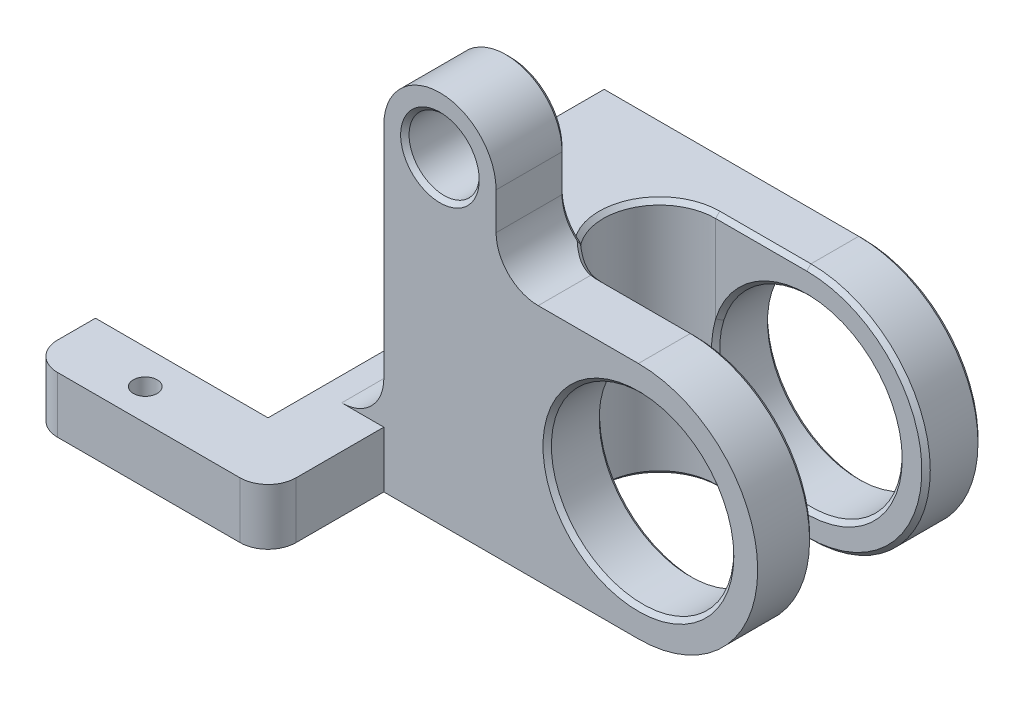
ISO-10303-21;
HEADER;
FILE_DESCRIPTION(('STEP AP214'),'2;1');
FILE_NAME('part.step','',(''),(''),'','','');
FILE_SCHEMA(('AUTOMOTIVE_DESIGN { 1 0 10303 214 1 1 1 1 }'));
ENDSEC;
DATA;
#1=APPLICATION_CONTEXT('core data for automotive mechanical design processes');
#2=APPLICATION_PROTOCOL_DEFINITION('international standard','automotive_design',2000,#1);
#3=PRODUCT_CONTEXT('',#1,'mechanical');
#4=PRODUCT('Part','Part','',(#3));
#5=PRODUCT_RELATED_PRODUCT_CATEGORY('part','',(#4));
#6=PRODUCT_DEFINITION_FORMATION('','',#4);
#7=PRODUCT_DEFINITION_CONTEXT('part definition',#1,'design');
#8=PRODUCT_DEFINITION('design','',#6,#7);
#9=PRODUCT_DEFINITION_SHAPE('','',#8);
#10=(LENGTH_UNIT() NAMED_UNIT(*) SI_UNIT(.MILLI.,.METRE.));
#11=(NAMED_UNIT(*) PLANE_ANGLE_UNIT() SI_UNIT($,.RADIAN.));
#12=(NAMED_UNIT(*) SI_UNIT($,.STERADIAN.) SOLID_ANGLE_UNIT());
#13=UNCERTAINTY_MEASURE_WITH_UNIT(LENGTH_MEASURE(1.E-05),#10,'distance_accuracy_value','');
#14=(GEOMETRIC_REPRESENTATION_CONTEXT(3) GLOBAL_UNCERTAINTY_ASSIGNED_CONTEXT((#13)) GLOBAL_UNIT_ASSIGNED_CONTEXT((#10,
#11,#12)) REPRESENTATION_CONTEXT('',''));
#15=CARTESIAN_POINT('',(0.,0.,0.));
#16=DIRECTION('',(0.,0.,1.));
#17=DIRECTION('',(1.,0.,0.));
#18=AXIS2_PLACEMENT_3D('',#15,#16,#17);
#19=CARTESIAN_POINT('',(-18.1421356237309,14.142135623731,8.));
#20=DIRECTION('',(1.,0.,0.));
#21=DIRECTION('',(0.,1.,0.));
#22=AXIS2_PLACEMENT_3D('',#19,#20,#21);
#23=PLANE('',#22);
#24=DIRECTION('',(0.,-1.,0.));
#25=VECTOR('',#24,1.);
#26=CARTESIAN_POINT('',(-18.1421356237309,14.142135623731,-8.));
#27=LINE('',#26,#25);
#28=CARTESIAN_POINT('',(-18.1421356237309,8.20000000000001,-8.));
#29=VERTEX_POINT('',#28);
#30=CARTESIAN_POINT('',(-18.1421356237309,-1.49999999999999,-8.));
#31=VERTEX_POINT('',#30);
#32=EDGE_CURVE('E359',#29,#31,#27,.T.);
#33=ORIENTED_EDGE('',*,*,#32,.T.);
#34=DIRECTION('',(0.,0.,1.));
#35=VECTOR('',#34,1.);
#36=CARTESIAN_POINT('',(-18.1421356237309,-1.5,7.99999999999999));
#37=LINE('',#36,#35);
#38=CARTESIAN_POINT('',(-18.1421356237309,-1.49999999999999,8.));
#39=VERTEX_POINT('',#38);
#40=EDGE_CURVE('E1048',#31,#39,#37,.T.);
#41=ORIENTED_EDGE('',*,*,#40,.T.);
#42=DIRECTION('',(0.,-1.,0.));
#43=VECTOR('',#42,1.);
#44=CARTESIAN_POINT('',(-18.1421356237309,14.142135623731,8.));
#45=LINE('',#44,#43);
#46=CARTESIAN_POINT('',(-18.1421356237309,14.142135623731,8.));
#47=VERTEX_POINT('',#46);
#48=EDGE_CURVE('E351',#47,#39,#45,.T.);
#49=ORIENTED_EDGE('',*,*,#48,.F.);
#50=DIRECTION('',(0.,0.,-1.));
#51=VECTOR('',#50,1.);
#52=CARTESIAN_POINT('',(-18.1421356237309,14.142135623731,8.));
#53=LINE('',#52,#51);
#54=CARTESIAN_POINT('',(-18.1421356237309,14.142135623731,3.30000000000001));
#55=VERTEX_POINT('',#54);
#56=EDGE_CURVE('E364',#47,#55,#53,.T.);
#57=ORIENTED_EDGE('',*,*,#56,.T.);
#58=DIRECTION('',(0.,-1.,0.));
#59=VECTOR('',#58,1.);
#60=CARTESIAN_POINT('',(-18.1421356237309,14.142135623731,3.30000000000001));
#61=LINE('',#60,#59);
#62=CARTESIAN_POINT('',(-18.1421356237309,8.5,3.30000000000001));
#63=VERTEX_POINT('',#62);
#64=EDGE_CURVE('E903',#55,#63,#61,.T.);
#65=ORIENTED_EDGE('',*,*,#64,.T.);
#66=DIRECTION('',(0.,0.,-1.));
#67=VECTOR('',#66,1.);
#68=CARTESIAN_POINT('',(-18.1421356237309,8.5,-8.));
#69=LINE('',#68,#67);
#70=CARTESIAN_POINT('',(-18.1421356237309,8.5,-7.7));
#71=VERTEX_POINT('',#70);
#72=EDGE_CURVE('E711',#63,#71,#69,.T.);
#73=ORIENTED_EDGE('',*,*,#72,.T.);
#74=DIRECTION('',(0.,0.707106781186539,0.707106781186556));
#75=VECTOR('',#74,1.);
#76=CARTESIAN_POINT('',(-18.1421356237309,8.5,-7.7));
#77=LINE('',#76,#75);
#78=EDGE_CURVE('E383',#71,#29,#77,.F.);
#79=ORIENTED_EDGE('',*,*,#78,.T.);
#80=EDGE_LOOP('',(#33,#41,#49,#57,#65,#73,#79));
#81=FACE_BOUND('',#80,.T.);
#82=ADVANCED_FACE('F35',(#81),#23,.F.);
#83=CARTESIAN_POINT('',(0.,0.,8.));
#84=DIRECTION('',(0.,0.,-1.));
#85=DIRECTION('',(-1.,0.,0.));
#86=AXIS2_PLACEMENT_3D('',#83,#84,#85);
#87=CYLINDRICAL_SURFACE('',#86,8.5);
#88=DIRECTION('',(0.,0.,-1.));
#89=VECTOR('',#88,1.);
#90=CARTESIAN_POINT('',(0.,-8.5,8.));
#91=LINE('',#90,#89);
#92=CARTESIAN_POINT('',(0.,-8.5,8.));
#93=VERTEX_POINT('',#92);
#94=CARTESIAN_POINT('',(0.,-8.5,4.3));
#95=VERTEX_POINT('',#94);
#96=EDGE_CURVE('E348',#93,#95,#91,.T.);
#97=ORIENTED_EDGE('',*,*,#96,.T.);
#98=CARTESIAN_POINT('',(0.,0.,4.3));
#99=DIRECTION('',(0.,0.,1.));
#100=DIRECTION('',(1.,0.,0.));
#101=AXIS2_PLACEMENT_3D('',#98,#99,#100);
#102=CIRCLE('',#101,8.5);
#103=CARTESIAN_POINT('',(0.,8.5,4.3));
#104=VERTEX_POINT('',#103);
#105=EDGE_CURVE('E912',#95,#104,#102,.T.);
#106=ORIENTED_EDGE('',*,*,#105,.T.);
#107=DIRECTION('',(0.,0.,-1.));
#108=VECTOR('',#107,1.);
#109=CARTESIAN_POINT('',(0.,8.5,8.));
#110=LINE('',#109,#108);
#111=CARTESIAN_POINT('',(0.,8.5,8.));
#112=VERTEX_POINT('',#111);
#113=EDGE_CURVE('E376',#112,#104,#110,.T.);
#114=ORIENTED_EDGE('',*,*,#113,.F.);
#115=CARTESIAN_POINT('',(0.,0.,8.));
#116=DIRECTION('',(0.,0.,1.));
#117=DIRECTION('',(1.,0.,0.));
#118=AXIS2_PLACEMENT_3D('',#115,#116,#117);
#119=CIRCLE('',#118,8.5);
#120=EDGE_CURVE('E361',#93,#112,#119,.T.);
#121=ORIENTED_EDGE('',*,*,#120,.F.);
#122=EDGE_LOOP('',(#97,#106,#114,#121));
#123=FACE_BOUND('',#122,.T.);
#124=ADVANCED_FACE('F418',(#123),#87,.T.);
#125=CARTESIAN_POINT('',(-7.14213562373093,8.5,8.));
#126=DIRECTION('',(0.,-1.,0.));
#127=DIRECTION('',(0.,0.,-1.));
#128=AXIS2_PLACEMENT_3D('',#125,#126,#127);
#129=PLANE('',#128);
#130=DIRECTION('',(-1.,0.,0.));
#131=VECTOR('',#130,1.);
#132=CARTESIAN_POINT('',(-7.14213562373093,8.5,4.3));
#133=LINE('',#132,#131);
#134=CARTESIAN_POINT('',(-6.5,8.5,4.3));
#135=VERTEX_POINT('',#134);
#136=EDGE_CURVE('E913',#104,#135,#133,.T.);
#137=ORIENTED_EDGE('',*,*,#136,.T.);
#138=CARTESIAN_POINT('',(-6.5,8.5,0.));
#139=DIRECTION('',(0.,-1.,0.));
#140=DIRECTION('',(0.,0.,-1.));
#141=AXIS2_PLACEMENT_3D('',#138,#139,#140);
#142=CIRCLE('',#141,4.3);
#143=CARTESIAN_POINT('',(-7.14213562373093,8.5,4.25178337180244));
#144=VERTEX_POINT('',#143);
#145=EDGE_CURVE('E813',#135,#144,#142,.T.);
#146=ORIENTED_EDGE('',*,*,#145,.T.);
#147=DIRECTION('',(0.,0.,-1.));
#148=VECTOR('',#147,1.);
#149=CARTESIAN_POINT('',(-7.14213562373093,8.5,8.));
#150=LINE('',#149,#148);
#151=CARTESIAN_POINT('',(-7.14213562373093,8.5,8.));
#152=VERTEX_POINT('',#151);
#153=EDGE_CURVE('E373',#152,#144,#150,.T.);
#154=ORIENTED_EDGE('',*,*,#153,.F.);
#155=DIRECTION('',(-1.,0.,0.));
#156=VECTOR('',#155,1.);
#157=CARTESIAN_POINT('',(-7.14213562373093,8.5,8.));
#158=LINE('',#157,#156);
#159=EDGE_CURVE('E1072',#112,#152,#158,.T.);
#160=ORIENTED_EDGE('',*,*,#159,.F.);
#161=ORIENTED_EDGE('',*,*,#113,.T.);
#162=EDGE_LOOP('',(#137,#146,#154,#160,#161));
#163=FACE_BOUND('',#162,.T.);
#164=ADVANCED_FACE('F413',(#163),#129,.F.);
#165=CARTESIAN_POINT('',(0.,0.,8.));
#166=DIRECTION('',(0.,0.,-1.));
#167=DIRECTION('',(-1.,0.,0.));
#168=AXIS2_PLACEMENT_3D('',#165,#166,#167);
#169=CYLINDRICAL_SURFACE('',#168,6.5);
#170=CARTESIAN_POINT('',(0.,0.,7.7));
#171=DIRECTION('',(0.,0.,1.));
#172=DIRECTION('',(1.,0.,0.));
#173=AXIS2_PLACEMENT_3D('',#170,#171,#172);
#174=CIRCLE('',#173,6.5);
#175=CARTESIAN_POINT('',(6.5,0.,7.7));
#176=VERTEX_POINT('',#175);
#177=EDGE_CURVE('E1120',#176,#176,#174,.T.);
#178=ORIENTED_EDGE('',*,*,#177,.T.);
#179=EDGE_LOOP('',(#178));
#180=FACE_BOUND('',#179,.T.);
#181=CARTESIAN_POINT('',(0.,0.,4.3));
#182=DIRECTION('',(0.,0.,1.));
#183=DIRECTION('',(1.,0.,0.));
#184=AXIS2_PLACEMENT_3D('',#181,#182,#183);
#185=CIRCLE('',#184,6.5);
#186=CARTESIAN_POINT('',(-6.21323529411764,1.90937350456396,4.3));
#187=VERTEX_POINT('',#186);
#188=CARTESIAN_POINT('',(-6.21323529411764,-1.90937350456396,4.3));
#189=VERTEX_POINT('',#188);
#190=EDGE_CURVE('E763',#187,#189,#185,.F.);
#191=ORIENTED_EDGE('',*,*,#190,.T.);
#192=CARTESIAN_POINT('',(-6.21323529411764,1.90937350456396,4.3));
#193=CARTESIAN_POINT('',(-6.26103595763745,1.75382020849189,4.29999670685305));
#194=CARTESIAN_POINT('',(-6.30275848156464,1.59728531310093,4.29914285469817));
#195=CARTESIAN_POINT('',(-6.3743095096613,1.28228881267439,4.29686030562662));
#196=CARTESIAN_POINT('',(-6.40413930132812,1.1238274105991,4.29543274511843));
#197=CARTESIAN_POINT('',(-6.44001630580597,0.884695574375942,4.29346830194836));
#198=CARTESIAN_POINT('',(-6.45049591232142,0.804744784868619,4.29284056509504));
#199=CARTESIAN_POINT('',(-6.46848597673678,0.644360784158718,4.29171097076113));
#200=CARTESIAN_POINT('',(-6.47599649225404,0.563927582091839,4.29120915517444));
#201=CARTESIAN_POINT('',(-6.48802576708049,0.402574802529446,4.29038447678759));
#202=CARTESIAN_POINT('',(-6.49254392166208,0.321652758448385,4.29006169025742));
#203=CARTESIAN_POINT('',(-6.49705246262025,0.199907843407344,4.2897369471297));
#204=CARTESIAN_POINT('',(-6.49817662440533,0.159230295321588,4.2896551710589));
#205=CARTESIAN_POINT('',(-6.49965981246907,0.0779362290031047,4.2895470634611));
#206=CARTESIAN_POINT('',(-6.50001943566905,0.0373446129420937,4.28952069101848));
#207=CARTESIAN_POINT('',(-6.49995879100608,-0.0842374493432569,4.28952514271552));
#208=CARTESIAN_POINT('',(-6.49840372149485,-0.16511679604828,4.28963977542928));
#209=CARTESIAN_POINT('',(-6.49230007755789,-0.326426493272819,4.29007908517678));
#210=CARTESIAN_POINT('',(-6.48775214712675,-0.40687414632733,4.29040360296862));
#211=CARTESIAN_POINT('',(-6.46966109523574,-0.647601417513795,4.29164271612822));
#212=CARTESIAN_POINT('',(-6.45167614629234,-0.807266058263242,4.29283158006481));
#213=CARTESIAN_POINT('',(-6.40392487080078,-1.12496645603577,4.29544275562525));
#214=CARTESIAN_POINT('',(-6.37415866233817,-1.28300222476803,4.29686602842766));
#215=CARTESIAN_POINT('',(-6.30271426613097,-1.59743051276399,4.29914335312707));
#216=CARTESIAN_POINT('',(-6.26103508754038,-1.75382289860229,4.2999966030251));
#217=CARTESIAN_POINT('',(-6.21323529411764,-1.90937350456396,4.3));
#218=B_SPLINE_CURVE_WITH_KNOTS('',3,(#192,#193,#194,#195,#196,#197,#198,#199,#200,#201,#202,
#203,#204,#205,#206,#207,#208,#209,#210,#211,#212,#213,#214,#215,#216,#217),.UNSPECIFIED.,.F.,
.F.,(4,2,2,2,2,2,2,2,2,2,2,2,4),(0.,0.000504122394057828,0.00100824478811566,
0.00126030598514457,0.00151236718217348,0.0017644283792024,0.00189045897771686,
0.00201648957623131,0.00226855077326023,0.00252061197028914,0.00302473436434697,
0.0035288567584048,0.00403297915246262),.UNSPECIFIED.);
#219=EDGE_CURVE('E542',#189,#187,#218,.F.);
#220=ORIENTED_EDGE('',*,*,#219,.T.);
#221=EDGE_LOOP('',(#191,#220));
#222=FACE_BOUND('',#221,.T.);
#223=ADVANCED_FACE('F1106',(#180,#222),#169,.F.);
#224=CARTESIAN_POINT('',(0.,0.,8.));
#225=DIRECTION('',(0.,0.,1.));
#226=DIRECTION('',(1.,0.,0.));
#227=AXIS2_PLACEMENT_3D('',#224,#225,#226);
#228=PLANE('',#227);
#229=CARTESIAN_POINT('',(0.,0.,8.));
#230=DIRECTION('',(0.,0.,1.));
#231=DIRECTION('',(1.,0.,0.));
#232=AXIS2_PLACEMENT_3D('',#229,#230,#231);
#233=CIRCLE('',#232,6.79999999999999);
#234=CARTESIAN_POINT('',(6.79999999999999,0.,8.));
#235=VERTEX_POINT('',#234);
#236=EDGE_CURVE('E821',#235,#235,#233,.F.);
#237=ORIENTED_EDGE('',*,*,#236,.T.);
#238=EDGE_LOOP('',(#237));
#239=FACE_BOUND('',#238,.T.);
#240=CARTESIAN_POINT('',(-14.1421356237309,14.142135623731,8.));
#241=DIRECTION('',(0.,0.,1.));
#242=DIRECTION('',(1.,0.,0.));
#243=AXIS2_PLACEMENT_3D('',#240,#241,#242);
#244=CIRCLE('',#243,2.80000000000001);
#245=CARTESIAN_POINT('',(-11.3421356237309,14.142135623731,8.));
#246=VERTEX_POINT('',#245);
#247=EDGE_CURVE('E826',#246,#246,#244,.F.);
#248=ORIENTED_EDGE('',*,*,#247,.T.);
#249=EDGE_LOOP('',(#248));
#250=FACE_BOUND('',#249,.T.);
#251=ORIENTED_EDGE('',*,*,#120,.T.);
#252=ORIENTED_EDGE('',*,*,#159,.T.);
#253=CARTESIAN_POINT('',(-7.14213562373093,11.5,8.));
#254=DIRECTION('',(0.,0.,-1.));
#255=DIRECTION('',(1.,0.,0.));
#256=AXIS2_PLACEMENT_3D('',#253,#254,#255);
#257=CIRCLE('',#256,3.);
#258=CARTESIAN_POINT('',(-10.1421356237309,11.5,8.));
#259=VERTEX_POINT('',#258);
#260=EDGE_CURVE('E1068',#152,#259,#257,.T.);
#261=ORIENTED_EDGE('',*,*,#260,.T.);
#262=DIRECTION('',(0.,1.,0.));
#263=VECTOR('',#262,1.);
#264=CARTESIAN_POINT('',(-10.1421356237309,14.142135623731,8.));
#265=LINE('',#264,#263);
#266=CARTESIAN_POINT('',(-10.1421356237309,14.142135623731,8.));
#267=VERTEX_POINT('',#266);
#268=EDGE_CURVE('E1067',#259,#267,#265,.T.);
#269=ORIENTED_EDGE('',*,*,#268,.T.);
#270=CARTESIAN_POINT('',(-14.1421356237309,14.142135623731,8.));
#271=DIRECTION('',(0.,0.,1.));
#272=DIRECTION('',(1.,0.,0.));
#273=AXIS2_PLACEMENT_3D('',#270,#271,#272);
#274=CIRCLE('',#273,4.);
#275=EDGE_CURVE('E355',#267,#47,#274,.T.);
#276=ORIENTED_EDGE('',*,*,#275,.T.);
#277=ORIENTED_EDGE('',*,*,#48,.T.);
#278=CARTESIAN_POINT('',(-21.1421356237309,-1.5,8.));
#279=DIRECTION('',(0.,0.,1.));
#280=DIRECTION('',(1.,0.,0.));
#281=AXIS2_PLACEMENT_3D('',#278,#279,#280);
#282=CIRCLE('',#281,3.);
#283=CARTESIAN_POINT('',(-21.1421356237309,-4.5,8.));
#284=VERTEX_POINT('',#283);
#285=EDGE_CURVE('E43',#39,#284,#282,.F.);
#286=ORIENTED_EDGE('',*,*,#285,.T.);
#287=DIRECTION('',(-1.,0.,0.));
#288=VECTOR('',#287,1.);
#289=CARTESIAN_POINT('',(0.,-4.5,8.));
#290=LINE('',#289,#288);
#291=CARTESIAN_POINT('',(-18.1421356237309,-4.5,7.99999999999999));
#292=VERTEX_POINT('',#291);
#293=EDGE_CURVE('E50',#292,#284,#290,.T.);
#294=ORIENTED_EDGE('',*,*,#293,.F.);
#295=DIRECTION('',(0.,1.,0.));
#296=VECTOR('',#295,1.);
#297=CARTESIAN_POINT('',(-18.1421356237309,0.,8.));
#298=LINE('',#297,#296);
#299=CARTESIAN_POINT('',(-18.1421356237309,-8.5,8.));
#300=VERTEX_POINT('',#299);
#301=EDGE_CURVE('E329',#300,#292,#298,.T.);
#302=ORIENTED_EDGE('',*,*,#301,.F.);
#303=DIRECTION('',(1.,0.,0.));
#304=VECTOR('',#303,1.);
#305=CARTESIAN_POINT('',(-18.1421356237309,-8.5,8.));
#306=LINE('',#305,#304);
#307=EDGE_CURVE('E339',#300,#93,#306,.T.);
#308=ORIENTED_EDGE('',*,*,#307,.T.);
#309=EDGE_LOOP('',(#251,#252,#261,#269,#276,#277,#286,#294,#302,#308));
#310=FACE_BOUND('',#309,.T.);
#311=ADVANCED_FACE('F338',(#239,#250,#310),#228,.T.);
#312=CARTESIAN_POINT('',(0.,0.,-8.));
#313=DIRECTION('',(0.,0.,1.));
#314=DIRECTION('',(1.,0.,0.));
#315=AXIS2_PLACEMENT_3D('',#312,#313,#314);
#316=PLANE('',#315);
#317=CARTESIAN_POINT('',(0.,0.,-8.));
#318=DIRECTION('',(0.,0.,1.));
#319=DIRECTION('',(1.,0.,0.));
#320=AXIS2_PLACEMENT_3D('',#317,#318,#319);
#321=CIRCLE('',#320,6.79999999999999);
#322=CARTESIAN_POINT('',(6.79999999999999,0.,-8.));
#323=VERTEX_POINT('',#322);
#324=EDGE_CURVE('E1084',#323,#323,#321,.T.);
#325=ORIENTED_EDGE('',*,*,#324,.T.);
#326=EDGE_LOOP('',(#325));
#327=FACE_BOUND('',#326,.T.);
#328=CARTESIAN_POINT('',(0.,0.,-8.));
#329=DIRECTION('',(0.,0.,1.));
#330=DIRECTION('',(1.,0.,0.));
#331=AXIS2_PLACEMENT_3D('',#328,#329,#330);
#332=CIRCLE('',#331,8.20000000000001);
#333=CARTESIAN_POINT('',(0.,8.20000000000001,-8.));
#334=VERTEX_POINT('',#333);
#335=CARTESIAN_POINT('',(0.,-8.20000000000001,-8.));
#336=VERTEX_POINT('',#335);
#337=EDGE_CURVE('E1078',#334,#336,#332,.F.);
#338=ORIENTED_EDGE('',*,*,#337,.T.);
#339=DIRECTION('',(-1.,0.,0.));
#340=VECTOR('',#339,1.);
#341=CARTESIAN_POINT('',(0.,-8.20000000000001,-8.));
#342=LINE('',#341,#340);
#343=CARTESIAN_POINT('',(-18.1421356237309,-8.20000000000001,-8.));
#344=VERTEX_POINT('',#343);
#345=EDGE_CURVE('E1080',#336,#344,#342,.T.);
#346=ORIENTED_EDGE('',*,*,#345,.T.);
#347=DIRECTION('',(0.,1.,0.));
#348=VECTOR('',#347,1.);
#349=CARTESIAN_POINT('',(-18.1421356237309,0.,-8.));
#350=LINE('',#349,#348);
#351=CARTESIAN_POINT('',(-18.1421356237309,-4.5,-8.));
#352=VERTEX_POINT('',#351);
#353=EDGE_CURVE('E342',#344,#352,#350,.T.);
#354=ORIENTED_EDGE('',*,*,#353,.T.);
#355=DIRECTION('',(1.,0.,0.));
#356=VECTOR('',#355,1.);
#357=CARTESIAN_POINT('',(0.,-4.5,-8.));
#358=LINE('',#357,#356);
#359=CARTESIAN_POINT('',(-21.1421356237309,-4.5,-8.));
#360=VERTEX_POINT('',#359);
#361=EDGE_CURVE('E1051',#360,#352,#358,.T.);
#362=ORIENTED_EDGE('',*,*,#361,.F.);
#363=CARTESIAN_POINT('',(-21.1421356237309,-1.5,-8.));
#364=DIRECTION('',(0.,0.,1.));
#365=DIRECTION('',(1.,0.,0.));
#366=AXIS2_PLACEMENT_3D('',#363,#364,#365);
#367=CIRCLE('',#366,3.);
#368=EDGE_CURVE('E11',#360,#31,#367,.T.);
#369=ORIENTED_EDGE('',*,*,#368,.T.);
#370=ORIENTED_EDGE('',*,*,#32,.F.);
#371=DIRECTION('',(1.,0.,0.));
#372=VECTOR('',#371,1.);
#373=CARTESIAN_POINT('',(0.,8.20000000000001,-8.));
#374=LINE('',#373,#372);
#375=EDGE_CURVE('E781',#29,#334,#374,.T.);
#376=ORIENTED_EDGE('',*,*,#375,.T.);
#377=EDGE_LOOP('',(#338,#346,#354,#362,#369,#370,#376));
#378=FACE_BOUND('',#377,.T.);
#379=ADVANCED_FACE('F416',(#327,#378),#316,.F.);
#380=CARTESIAN_POINT('',(0.,-8.5,-4.3));
#381=VERTEX_POINT('',#380);
#382=CARTESIAN_POINT('',(0.,-8.5,-7.7));
#383=VERTEX_POINT('',#382);
#384=EDGE_CURVE('E350',#381,#383,#91,.T.);
#385=ORIENTED_EDGE('',*,*,#384,.T.);
#386=CARTESIAN_POINT('',(0.,0.,-7.7));
#387=DIRECTION('',(0.,0.,1.));
#388=DIRECTION('',(1.,0.,0.));
#389=AXIS2_PLACEMENT_3D('',#386,#387,#388);
#390=CIRCLE('',#389,8.5);
#391=CARTESIAN_POINT('',(0.,8.5,-7.7));
#392=VERTEX_POINT('',#391);
#393=EDGE_CURVE('E898',#383,#392,#390,.T.);
#394=ORIENTED_EDGE('',*,*,#393,.T.);
#395=CARTESIAN_POINT('',(0.,8.5,-4.3));
#396=VERTEX_POINT('',#395);
#397=EDGE_CURVE('E382',#396,#392,#110,.T.);
#398=ORIENTED_EDGE('',*,*,#397,.F.);
#399=CARTESIAN_POINT('',(0.,0.,-4.3));
#400=DIRECTION('',(0.,0.,-1.));
#401=DIRECTION('',(-1.,0.,0.));
#402=AXIS2_PLACEMENT_3D('',#399,#400,#401);
#403=CIRCLE('',#402,8.5);
#404=EDGE_CURVE('E896',#396,#381,#403,.T.);
#405=ORIENTED_EDGE('',*,*,#404,.T.);
#406=EDGE_LOOP('',(#385,#394,#398,#405));
#407=FACE_BOUND('',#406,.T.);
#408=ADVANCED_FACE('F411',(#407),#87,.T.);
#409=ORIENTED_EDGE('',*,*,#397,.T.);
#410=DIRECTION('',(-1.,0.,0.));
#411=VECTOR('',#410,1.);
#412=CARTESIAN_POINT('',(-7.14213562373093,8.5,-7.7));
#413=LINE('',#412,#411);
#414=EDGE_CURVE('E902',#392,#71,#413,.T.);
#415=ORIENTED_EDGE('',*,*,#414,.T.);
#416=ORIENTED_EDGE('',*,*,#72,.F.);
#417=DIRECTION('',(-0.707106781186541,0.,0.707106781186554));
#418=VECTOR('',#417,1.);
#419=CARTESIAN_POINT('',(-14.992135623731,8.5,0.150000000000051));
#420=LINE('',#419,#418);
#421=CARTESIAN_POINT('',(-17.8421356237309,8.5,3.));
#422=VERTEX_POINT('',#421);
#423=EDGE_CURVE('E937',#63,#422,#420,.F.);
#424=ORIENTED_EDGE('',*,*,#423,.T.);
#425=DIRECTION('',(1.,0.,0.));
#426=VECTOR('',#425,1.);
#427=CARTESIAN_POINT('',(-18.1421356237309,8.5,3.));
#428=LINE('',#427,#426);
#429=CARTESIAN_POINT('',(-9.58058436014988,8.5,3.));
#430=VERTEX_POINT('',#429);
#431=EDGE_CURVE('E362',#422,#430,#428,.T.);
#432=ORIENTED_EDGE('',*,*,#431,.T.);
#433=CARTESIAN_POINT('',(-6.5,8.5,0.));
#434=DIRECTION('',(0.,-1.,0.));
#435=DIRECTION('',(0.,0.,-1.));
#436=AXIS2_PLACEMENT_3D('',#433,#434,#435);
#437=CIRCLE('',#436,4.3);
#438=CARTESIAN_POINT('',(-6.5,8.5,-4.3));
#439=VERTEX_POINT('',#438);
#440=EDGE_CURVE('E777',#430,#439,#437,.T.);
#441=ORIENTED_EDGE('',*,*,#440,.T.);
#442=DIRECTION('',(1.,0.,0.));
#443=VECTOR('',#442,1.);
#444=CARTESIAN_POINT('',(-7.14213562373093,8.5,-4.3));
#445=LINE('',#444,#443);
#446=EDGE_CURVE('E771',#439,#396,#445,.T.);
#447=ORIENTED_EDGE('',*,*,#446,.T.);
#448=EDGE_LOOP('',(#409,#415,#416,#424,#432,#441,#447));
#449=FACE_BOUND('',#448,.T.);
#450=ADVANCED_FACE('F407',(#449),#129,.F.);
#451=CARTESIAN_POINT('',(-7.14213562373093,11.5,8.));
#452=DIRECTION('',(0.,0.,-1.));
#453=DIRECTION('',(-1.,0.,0.));
#454=AXIS2_PLACEMENT_3D('',#451,#452,#453);
#455=CYLINDRICAL_SURFACE('',#454,3.);
#456=ORIENTED_EDGE('',*,*,#153,.T.);
#457=CARTESIAN_POINT('',(-9.28751606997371,9.40301579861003,3.07858264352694));
#458=CARTESIAN_POINT('',(-9.22433569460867,9.33838154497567,3.14635162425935));
#459=CARTESIAN_POINT('',(-9.15789439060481,9.276225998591,3.21304017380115));
#460=CARTESIAN_POINT('',(-9.01793968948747,9.15696562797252,3.34370309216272));
#461=CARTESIAN_POINT('',(-8.94441521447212,9.09985125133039,3.40768979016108));
#462=CARTESIAN_POINT('',(-8.84764022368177,9.03183856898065,3.48560192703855));
#463=CARTESIAN_POINT('',(-8.82802597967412,9.0183991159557,3.50108922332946));
#464=CARTESIAN_POINT('',(-8.78831450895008,8.99187999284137,3.5318319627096));
#465=CARTESIAN_POINT('',(-8.76817932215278,8.97877766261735,3.54711439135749));
#466=CARTESIAN_POINT('',(-8.70718322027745,8.94012855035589,3.59247720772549));
#467=CARTESIAN_POINT('',(-8.66580802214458,8.91528083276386,3.62202250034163));
#468=CARTESIAN_POINT('',(-8.58148889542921,8.86739428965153,3.67973781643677));
#469=CARTESIAN_POINT('',(-8.53856213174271,8.84436589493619,3.70789552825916));
#470=CARTESIAN_POINT('',(-8.45111858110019,8.80019204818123,3.76274777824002));
#471=CARTESIAN_POINT('',(-8.40660191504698,8.77904647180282,3.78944244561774));
#472=CARTESIAN_POINT('',(-8.31590971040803,8.73871093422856,3.8412967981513));
#473=CARTESIAN_POINT('',(-8.26973433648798,8.71952078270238,3.86645663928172));
#474=CARTESIAN_POINT('',(-8.17563995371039,8.68319115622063,3.91515826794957));
#475=CARTESIAN_POINT('',(-8.12771561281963,8.66605083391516,3.93870167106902));
#476=CARTESIAN_POINT('',(-8.05445997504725,8.64197122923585,3.97272590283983));
#477=CARTESIAN_POINT('',(-8.02977586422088,8.63420725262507,3.98386677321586));
#478=CARTESIAN_POINT('',(-7.98009075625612,8.619287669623,4.00563657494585));
#479=CARTESIAN_POINT('',(-7.95513996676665,8.61214580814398,4.01624474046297));
#480=CARTESIAN_POINT('',(-7.87996892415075,8.59168563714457,4.04722877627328));
#481=CARTESIAN_POINT('',(-7.8293548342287,8.57930480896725,4.0668018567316));
#482=CARTESIAN_POINT('',(-7.72722130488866,8.55714334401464,4.10370498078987));
#483=CARTESIAN_POINT('',(-7.67568390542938,8.54735648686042,4.12104362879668));
#484=CARTESIAN_POINT('',(-7.57164818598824,8.53043836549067,4.15345696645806));
#485=CARTESIAN_POINT('',(-7.51914993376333,8.52330684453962,4.16853177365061));
#486=CARTESIAN_POINT('',(-7.3601735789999,8.50603549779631,4.21028281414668));
#487=CARTESIAN_POINT('',(-7.25221767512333,8.50000507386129,4.23349260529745));
#488=CARTESIAN_POINT('',(-7.14213562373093,8.5,4.25178337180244));
#489=B_SPLINE_CURVE_WITH_KNOTS('',3,(#457,#458,#459,#460,#461,#462,#463,#464,#465,#466,#467,
#468,#469,#470,#471,#472,#473,#474,#475,#476,#477,#478,#479,#480,#481,#482,#483,#484,#485,#486,
#487,#488),.UNSPECIFIED.,.F.,.F.,(4,2,2,2,2,2,2,2,2,2,2,2,2,2,2,4),(0.,0.000361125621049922,
0.000722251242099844,0.000812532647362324,0.000902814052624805,0.00108337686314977,
0.00126393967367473,0.00144450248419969,0.00162506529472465,0.00180562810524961,
0.00189590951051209,0.00198619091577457,0.00216675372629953,0.00234731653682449,
0.00252787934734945,0.00288900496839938),.UNSPECIFIED.);
#490=CARTESIAN_POINT('',(-9.06456660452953,9.19690227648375,3.30000000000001));
#491=VERTEX_POINT('',#490);
#492=EDGE_CURVE('E388',#144,#491,#489,.F.);
#493=ORIENTED_EDGE('',*,*,#492,.T.);
#494=CARTESIAN_POINT('',(-7.14213562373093,11.5,3.30000000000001));
#495=DIRECTION('',(0.,0.,1.));
#496=DIRECTION('',(1.,0.,0.));
#497=AXIS2_PLACEMENT_3D('',#494,#495,#496);
#498=CIRCLE('',#497,3.);
#499=CARTESIAN_POINT('',(-10.1421356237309,11.5,3.30000000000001));
#500=VERTEX_POINT('',#499);
#501=EDGE_CURVE('E394',#491,#500,#498,.F.);
#502=ORIENTED_EDGE('',*,*,#501,.T.);
#503=DIRECTION('',(0.,0.,-1.));
#504=VECTOR('',#503,1.);
#505=CARTESIAN_POINT('',(-10.1421356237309,11.5,8.));
#506=LINE('',#505,#504);
#507=EDGE_CURVE('E370',#259,#500,#506,.T.);
#508=ORIENTED_EDGE('',*,*,#507,.F.);
#509=ORIENTED_EDGE('',*,*,#260,.F.);
#510=EDGE_LOOP('',(#456,#493,#502,#508,#509));
#511=FACE_BOUND('',#510,.T.);
#512=ADVANCED_FACE('F396',(#511),#455,.F.);
#513=CARTESIAN_POINT('',(-10.1421356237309,14.142135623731,8.));
#514=DIRECTION('',(-1.,0.,0.));
#515=DIRECTION('',(0.,0.,1.));
#516=AXIS2_PLACEMENT_3D('',#513,#514,#515);
#517=PLANE('',#516);
#518=ORIENTED_EDGE('',*,*,#507,.T.);
#519=DIRECTION('',(0.,1.,0.));
#520=VECTOR('',#519,1.);
#521=CARTESIAN_POINT('',(-10.1421356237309,14.142135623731,3.30000000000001));
#522=LINE('',#521,#520);
#523=CARTESIAN_POINT('',(-10.1421356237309,14.142135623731,3.30000000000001));
#524=VERTEX_POINT('',#523);
#525=EDGE_CURVE('E923',#500,#524,#522,.T.);
#526=ORIENTED_EDGE('',*,*,#525,.T.);
#527=DIRECTION('',(0.,0.,-1.));
#528=VECTOR('',#527,1.);
#529=CARTESIAN_POINT('',(-10.1421356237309,14.142135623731,8.));
#530=LINE('',#529,#528);
#531=EDGE_CURVE('E367',#267,#524,#530,.T.);
#532=ORIENTED_EDGE('',*,*,#531,.F.);
#533=ORIENTED_EDGE('',*,*,#268,.F.);
#534=EDGE_LOOP('',(#518,#526,#532,#533));
#535=FACE_BOUND('',#534,.T.);
#536=ADVANCED_FACE('F406',(#535),#517,.F.);
#537=CARTESIAN_POINT('',(-14.1421356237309,14.142135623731,8.));
#538=DIRECTION('',(0.,0.,-1.));
#539=DIRECTION('',(-1.,0.,0.));
#540=AXIS2_PLACEMENT_3D('',#537,#538,#539);
#541=CYLINDRICAL_SURFACE('',#540,4.);
#542=ORIENTED_EDGE('',*,*,#531,.T.);
#543=CARTESIAN_POINT('',(-14.1421356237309,14.142135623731,3.30000000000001));
#544=DIRECTION('',(0.,0.,1.));
#545=DIRECTION('',(1.,0.,0.));
#546=AXIS2_PLACEMENT_3D('',#543,#544,#545);
#547=CIRCLE('',#546,4.);
#548=EDGE_CURVE('E927',#524,#55,#547,.T.);
#549=ORIENTED_EDGE('',*,*,#548,.T.);
#550=ORIENTED_EDGE('',*,*,#56,.F.);
#551=ORIENTED_EDGE('',*,*,#275,.F.);
#552=EDGE_LOOP('',(#542,#549,#550,#551));
#553=FACE_BOUND('',#552,.T.);
#554=ADVANCED_FACE('F978',(#553),#541,.T.);
#555=CARTESIAN_POINT('',(-18.1421356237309,-8.5,8.));
#556=DIRECTION('',(0.,1.,0.));
#557=DIRECTION('',(0.,0.,1.));
#558=AXIS2_PLACEMENT_3D('',#555,#556,#557);
#559=PLANE('',#558);
#560=DIRECTION('',(0.,0.,-1.));
#561=VECTOR('',#560,1.);
#562=CARTESIAN_POINT('',(-35.1421356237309,-8.5,-11.25));
#563=LINE('',#562,#561);
#564=CARTESIAN_POINT('',(-35.1421356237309,-8.5,-11.55));
#565=VERTEX_POINT('',#564);
#566=CARTESIAN_POINT('',(-35.1421356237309,-8.5,-14.25));
#567=VERTEX_POINT('',#566);
#568=EDGE_CURVE('E1219',#565,#567,#563,.T.);
#569=ORIENTED_EDGE('',*,*,#568,.T.);
#570=CARTESIAN_POINT('',(-33.1421356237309,-8.5,-14.25));
#571=DIRECTION('',(0.,1.,0.));
#572=DIRECTION('',(0.,0.,1.));
#573=AXIS2_PLACEMENT_3D('',#570,#571,#572);
#574=CIRCLE('',#573,2.);
#575=CARTESIAN_POINT('',(-33.1421356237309,-8.5,-16.25));
#576=VERTEX_POINT('',#575);
#577=EDGE_CURVE('E1023',#567,#576,#574,.F.);
#578=ORIENTED_EDGE('',*,*,#577,.T.);
#579=DIRECTION('',(1.,0.,0.));
#580=VECTOR('',#579,1.);
#581=CARTESIAN_POINT('',(-35.1421356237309,-8.5,-16.25));
#582=LINE('',#581,#580);
#583=CARTESIAN_POINT('',(-20.1421356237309,-8.5,-16.25));
#584=VERTEX_POINT('',#583);
#585=EDGE_CURVE('E1221',#576,#584,#582,.T.);
#586=ORIENTED_EDGE('',*,*,#585,.T.);
#587=CARTESIAN_POINT('',(-20.1421356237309,-8.5,-14.25));
#588=DIRECTION('',(0.,1.,0.));
#589=DIRECTION('',(0.,0.,1.));
#590=AXIS2_PLACEMENT_3D('',#587,#588,#589);
#591=CIRCLE('',#590,2.);
#592=CARTESIAN_POINT('',(-18.1421356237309,-8.5,-14.25));
#593=VERTEX_POINT('',#592);
#594=EDGE_CURVE('E1014',#584,#593,#591,.F.);
#595=ORIENTED_EDGE('',*,*,#594,.T.);
#596=DIRECTION('',(0.,0.,1.));
#597=VECTOR('',#596,1.);
#598=CARTESIAN_POINT('',(-18.1421356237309,-8.5,8.));
#599=LINE('',#598,#597);
#600=CARTESIAN_POINT('',(-18.1421356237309,-8.5,-7.7));
#601=VERTEX_POINT('',#600);
#602=EDGE_CURVE('E334',#593,#601,#599,.T.);
#603=ORIENTED_EDGE('',*,*,#602,.T.);
#604=DIRECTION('',(1.,0.,0.));
#605=VECTOR('',#604,1.);
#606=CARTESIAN_POINT('',(-18.1421356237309,-8.5,-7.7));
#607=LINE('',#606,#605);
#608=EDGE_CURVE('E857',#601,#383,#607,.T.);
#609=ORIENTED_EDGE('',*,*,#608,.T.);
#610=ORIENTED_EDGE('',*,*,#384,.F.);
#611=DIRECTION('',(-1.,0.,0.));
#612=VECTOR('',#611,1.);
#613=CARTESIAN_POINT('',(-18.1421356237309,-8.5,-4.3));
#614=LINE('',#613,#612);
#615=CARTESIAN_POINT('',(-6.5,-8.5,-4.3));
#616=VERTEX_POINT('',#615);
#617=EDGE_CURVE('E855',#381,#616,#614,.T.);
#618=ORIENTED_EDGE('',*,*,#617,.T.);
#619=CARTESIAN_POINT('',(-6.5,-8.5,0.));
#620=DIRECTION('',(0.,1.,0.));
#621=DIRECTION('',(0.,0.,1.));
#622=AXIS2_PLACEMENT_3D('',#619,#620,#621);
#623=CIRCLE('',#622,4.3);
#624=CARTESIAN_POINT('',(-6.5,-8.5,4.3));
#625=VERTEX_POINT('',#624);
#626=EDGE_CURVE('E853',#616,#625,#623,.T.);
#627=ORIENTED_EDGE('',*,*,#626,.T.);
#628=DIRECTION('',(1.,0.,0.));
#629=VECTOR('',#628,1.);
#630=CARTESIAN_POINT('',(-18.1421356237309,-8.5,4.30000000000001));
#631=LINE('',#630,#629);
#632=EDGE_CURVE('E851',#625,#95,#631,.T.);
#633=ORIENTED_EDGE('',*,*,#632,.T.);
#634=ORIENTED_EDGE('',*,*,#96,.F.);
#635=ORIENTED_EDGE('',*,*,#307,.F.);
#636=CARTESIAN_POINT('',(-18.1421356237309,-8.5,14.25));
#637=VERTEX_POINT('',#636);
#638=EDGE_CURVE('E326',#300,#637,#599,.T.);
#639=ORIENTED_EDGE('',*,*,#638,.T.);
#640=CARTESIAN_POINT('',(-20.1421356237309,-8.5,14.25));
#641=DIRECTION('',(0.,1.,0.));
#642=DIRECTION('',(0.,0.,1.));
#643=AXIS2_PLACEMENT_3D('',#640,#641,#642);
#644=CIRCLE('',#643,2.);
#645=CARTESIAN_POINT('',(-20.1421356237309,-8.5,16.25));
#646=VERTEX_POINT('',#645);
#647=EDGE_CURVE('E1008',#637,#646,#644,.F.);
#648=ORIENTED_EDGE('',*,*,#647,.T.);
#649=DIRECTION('',(-1.,0.,0.));
#650=VECTOR('',#649,1.);
#651=CARTESIAN_POINT('',(-18.1421356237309,-8.5,16.25));
#652=LINE('',#651,#650);
#653=CARTESIAN_POINT('',(-33.1421356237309,-8.5,16.25));
#654=VERTEX_POINT('',#653);
#655=EDGE_CURVE('E1214',#646,#654,#652,.T.);
#656=ORIENTED_EDGE('',*,*,#655,.T.);
#657=CARTESIAN_POINT('',(-33.1421356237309,-8.5,14.25));
#658=DIRECTION('',(0.,1.,0.));
#659=DIRECTION('',(0.,0.,1.));
#660=AXIS2_PLACEMENT_3D('',#657,#658,#659);
#661=CIRCLE('',#660,2.);
#662=CARTESIAN_POINT('',(-35.1421356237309,-8.5,14.25));
#663=VERTEX_POINT('',#662);
#664=EDGE_CURVE('E1021',#654,#663,#661,.F.);
#665=ORIENTED_EDGE('',*,*,#664,.T.);
#666=DIRECTION('',(0.,0.,-1.));
#667=VECTOR('',#666,1.);
#668=CARTESIAN_POINT('',(-35.1421356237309,-8.5,16.25));
#669=LINE('',#668,#667);
#670=CARTESIAN_POINT('',(-35.1421356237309,-8.5,11.55));
#671=VERTEX_POINT('',#670);
#672=EDGE_CURVE('E1217',#663,#671,#669,.T.);
#673=ORIENTED_EDGE('',*,*,#672,.T.);
#674=DIRECTION('',(1.,0.,0.));
#675=VECTOR('',#674,1.);
#676=CARTESIAN_POINT('',(-23.1421356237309,-8.5,11.55));
#677=LINE('',#676,#675);
#678=CARTESIAN_POINT('',(-22.8421356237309,-8.5,11.55));
#679=VERTEX_POINT('',#678);
#680=EDGE_CURVE('E864',#671,#679,#677,.T.);
#681=ORIENTED_EDGE('',*,*,#680,.T.);
#682=DIRECTION('',(0.,0.,-1.));
#683=VECTOR('',#682,1.);
#684=CARTESIAN_POINT('',(-22.8421356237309,-8.5,-11.25));
#685=LINE('',#684,#683);
#686=CARTESIAN_POINT('',(-22.8421356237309,-8.5,-11.55));
#687=VERTEX_POINT('',#686);
#688=EDGE_CURVE('E862',#679,#687,#685,.T.);
#689=ORIENTED_EDGE('',*,*,#688,.T.);
#690=DIRECTION('',(-1.,0.,0.));
#691=VECTOR('',#690,1.);
#692=CARTESIAN_POINT('',(-35.1421356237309,-8.5,-11.55));
#693=LINE('',#692,#691);
#694=EDGE_CURVE('E860',#687,#565,#693,.T.);
#695=ORIENTED_EDGE('',*,*,#694,.T.);
#696=EDGE_LOOP('',(#569,#578,#586,#595,#603,#609,#610,#618,#627,#633,#634,#635,#639,#648,#656,
#665,#673,#681,#689,#695));
#697=FACE_BOUND('',#696,.T.);
#698=CARTESIAN_POINT('',(-29.1421356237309,-8.5,-14.));
#699=DIRECTION('',(0.,-1.,0.));
#700=DIRECTION('',(0.,0.,1.));
#701=AXIS2_PLACEMENT_3D('',#698,#699,#700);
#702=CIRCLE('',#701,0.85);
#703=CARTESIAN_POINT('',(-29.1421356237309,-8.5,-13.15));
#704=VERTEX_POINT('',#703);
#705=EDGE_CURVE('E1186',#704,#704,#702,.T.);
#706=ORIENTED_EDGE('',*,*,#705,.F.);
#707=EDGE_LOOP('',(#706));
#708=FACE_BOUND('',#707,.T.);
#709=CARTESIAN_POINT('',(-29.1421356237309,-8.5,14.));
#710=DIRECTION('',(0.,-1.,0.));
#711=DIRECTION('',(0.,0.,-1.));
#712=AXIS2_PLACEMENT_3D('',#709,#710,#711);
#713=CIRCLE('',#712,0.85);
#714=CARTESIAN_POINT('',(-29.1421356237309,-8.5,13.15));
#715=VERTEX_POINT('',#714);
#716=EDGE_CURVE('E1193',#715,#715,#713,.T.);
#717=ORIENTED_EDGE('',*,*,#716,.F.);
#718=EDGE_LOOP('',(#717));
#719=FACE_BOUND('',#718,.T.);
#720=ADVANCED_FACE('F345',(#697,#708,#719),#559,.F.);
#721=CARTESIAN_POINT('',(0.,0.,-7.7));
#722=DIRECTION('',(0.,0.,1.));
#723=DIRECTION('',(1.,0.,0.));
#724=AXIS2_PLACEMENT_3D('',#721,#722,#723);
#725=CIRCLE('',#724,6.5);
#726=CARTESIAN_POINT('',(6.5,0.,-7.7));
#727=VERTEX_POINT('',#726);
#728=EDGE_CURVE('E731',#727,#727,#725,.F.);
#729=ORIENTED_EDGE('',*,*,#728,.T.);
#730=EDGE_LOOP('',(#729));
#731=FACE_BOUND('',#730,.T.);
#732=CARTESIAN_POINT('',(0.,0.,-4.3));
#733=DIRECTION('',(0.,0.,-1.));
#734=DIRECTION('',(-1.,0.,0.));
#735=AXIS2_PLACEMENT_3D('',#732,#733,#734);
#736=CIRCLE('',#735,6.5);
#737=CARTESIAN_POINT('',(-6.21323529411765,-1.90937350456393,-4.3));
#738=VERTEX_POINT('',#737);
#739=CARTESIAN_POINT('',(-6.21323529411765,1.90937350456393,-4.3));
#740=VERTEX_POINT('',#739);
#741=EDGE_CURVE('E1087',#738,#740,#736,.F.);
#742=ORIENTED_EDGE('',*,*,#741,.T.);
#743=CARTESIAN_POINT('',(-6.21323529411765,-1.90937350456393,-4.3));
#744=CARTESIAN_POINT('',(-6.26103595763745,-1.75382020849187,-4.29999670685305));
#745=CARTESIAN_POINT('',(-6.30275848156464,-1.59728531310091,-4.29914285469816));
#746=CARTESIAN_POINT('',(-6.37430950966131,-1.28228881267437,-4.29686030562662));
#747=CARTESIAN_POINT('',(-6.40413930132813,-1.12382741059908,-4.29543274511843));
#748=CARTESIAN_POINT('',(-6.44001630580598,-0.884695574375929,-4.29346830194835));
#749=CARTESIAN_POINT('',(-6.45049591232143,-0.804744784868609,-4.29284056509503));
#750=CARTESIAN_POINT('',(-6.46848597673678,-0.64436078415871,-4.29171097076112));
#751=CARTESIAN_POINT('',(-6.47599649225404,-0.56392758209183,-4.29120915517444));
#752=CARTESIAN_POINT('',(-6.48802576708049,-0.402574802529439,-4.29038447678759));
#753=CARTESIAN_POINT('',(-6.49254392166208,-0.321652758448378,-4.29006169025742));
#754=CARTESIAN_POINT('',(-6.49705246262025,-0.199907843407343,-4.2897369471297));
#755=CARTESIAN_POINT('',(-6.49817662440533,-0.159230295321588,-4.2896551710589));
#756=CARTESIAN_POINT('',(-6.49965981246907,-0.0779362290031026,-4.2895470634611));
#757=CARTESIAN_POINT('',(-6.50001943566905,-0.0373446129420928,-4.28952069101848));
#758=CARTESIAN_POINT('',(-6.49995879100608,0.0842374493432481,-4.28952514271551));
#759=CARTESIAN_POINT('',(-6.49840372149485,0.165116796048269,-4.28963977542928));
#760=CARTESIAN_POINT('',(-6.49230007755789,0.32642649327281,-4.29007908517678));
#761=CARTESIAN_POINT('',(-6.48775214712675,0.406874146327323,-4.29040360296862));
#762=CARTESIAN_POINT('',(-6.46966109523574,0.647601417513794,-4.29164271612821));
#763=CARTESIAN_POINT('',(-6.45167614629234,0.80726605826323,-4.29283158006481));
#764=CARTESIAN_POINT('',(-6.40392487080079,1.12496645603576,-4.29544275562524));
#765=CARTESIAN_POINT('',(-6.37415866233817,1.28300222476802,-4.29686602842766));
#766=CARTESIAN_POINT('',(-6.30271426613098,1.59743051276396,-4.29914335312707));
#767=CARTESIAN_POINT('',(-6.26103508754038,1.75382289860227,-4.2999966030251));
#768=CARTESIAN_POINT('',(-6.21323529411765,1.90937350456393,-4.3));
#769=B_SPLINE_CURVE_WITH_KNOTS('',3,(#743,#744,#745,#746,#747,#748,#749,#750,#751,#752,#753,
#754,#755,#756,#757,#758,#759,#760,#761,#762,#763,#764,#765,#766,#767,#768),.UNSPECIFIED.,.F.,
.F.,(4,2,2,2,2,2,2,2,2,2,2,2,4),(0.,0.000504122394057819,0.00100824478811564,
0.00126030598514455,0.00151236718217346,0.00176442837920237,0.00189045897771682,
0.00201648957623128,0.00226855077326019,0.0025206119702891,0.00302473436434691,
0.00352885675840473,0.00403297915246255),.UNSPECIFIED.);
#770=EDGE_CURVE('E469',#740,#738,#769,.F.);
#771=ORIENTED_EDGE('',*,*,#770,.T.);
#772=EDGE_LOOP('',(#742,#771));
#773=FACE_BOUND('',#772,.T.);
#774=ADVANCED_FACE('F985',(#731,#773),#169,.F.);
#775=CARTESIAN_POINT('',(-14.1421356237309,14.142135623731,8.));
#776=DIRECTION('',(0.,0.,-1.));
#777=DIRECTION('',(-1.,0.,0.));
#778=AXIS2_PLACEMENT_3D('',#775,#776,#777);
#779=CYLINDRICAL_SURFACE('',#778,2.5);
#780=CARTESIAN_POINT('',(-14.1421356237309,14.142135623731,7.69999999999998));
#781=DIRECTION('',(0.,0.,1.));
#782=DIRECTION('',(1.,0.,0.));
#783=AXIS2_PLACEMENT_3D('',#780,#781,#782);
#784=CIRCLE('',#783,2.5);
#785=CARTESIAN_POINT('',(-11.6421356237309,14.142135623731,7.69999999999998));
#786=VERTEX_POINT('',#785);
#787=EDGE_CURVE('E838',#786,#786,#784,.T.);
#788=ORIENTED_EDGE('',*,*,#787,.T.);
#789=EDGE_LOOP('',(#788));
#790=FACE_BOUND('',#789,.T.);
#791=CARTESIAN_POINT('',(-14.1421356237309,14.142135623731,3.3));
#792=DIRECTION('',(0.,0.,1.));
#793=DIRECTION('',(1.,0.,0.));
#794=AXIS2_PLACEMENT_3D('',#791,#792,#793);
#795=CIRCLE('',#794,2.5);
#796=CARTESIAN_POINT('',(-11.6421356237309,14.142135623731,3.3));
#797=VERTEX_POINT('',#796);
#798=EDGE_CURVE('E833',#797,#797,#795,.F.);
#799=ORIENTED_EDGE('',*,*,#798,.T.);
#800=EDGE_LOOP('',(#799));
#801=FACE_BOUND('',#800,.T.);
#802=ADVANCED_FACE('F1104',(#790,#801),#779,.F.);
#803=CARTESIAN_POINT('',(-18.1421356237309,18.142135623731,3.));
#804=DIRECTION('',(0.,0.,1.));
#805=DIRECTION('',(1.,0.,0.));
#806=AXIS2_PLACEMENT_3D('',#803,#804,#805);
#807=PLANE('',#806);
#808=CARTESIAN_POINT('',(-14.1421356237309,14.142135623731,3.));
#809=DIRECTION('',(0.,0.,1.));
#810=DIRECTION('',(1.,0.,0.));
#811=AXIS2_PLACEMENT_3D('',#808,#809,#810);
#812=CIRCLE('',#811,2.8);
#813=CARTESIAN_POINT('',(-11.3421356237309,14.142135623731,3.));
#814=VERTEX_POINT('',#813);
#815=EDGE_CURVE('E848',#814,#814,#812,.T.);
#816=ORIENTED_EDGE('',*,*,#815,.T.);
#817=EDGE_LOOP('',(#816));
#818=FACE_BOUND('',#817,.T.);
#819=DIRECTION('',(0.,-1.,0.));
#820=VECTOR('',#819,1.);
#821=CARTESIAN_POINT('',(-10.4421356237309,18.142135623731,3.));
#822=LINE('',#821,#820);
#823=CARTESIAN_POINT('',(-10.4421356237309,14.142135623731,3.));
#824=VERTEX_POINT('',#823);
#825=CARTESIAN_POINT('',(-10.4421356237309,11.5,3.));
#826=VERTEX_POINT('',#825);
#827=EDGE_CURVE('E845',#824,#826,#822,.T.);
#828=ORIENTED_EDGE('',*,*,#827,.T.);
#829=CARTESIAN_POINT('',(-7.14213562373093,11.5,3.));
#830=DIRECTION('',(0.,0.,1.));
#831=DIRECTION('',(1.,0.,0.));
#832=AXIS2_PLACEMENT_3D('',#829,#830,#831);
#833=CIRCLE('',#832,3.3);
#834=CARTESIAN_POINT('',(-9.14575131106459,8.87787792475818,3.));
#835=VERTEX_POINT('',#834);
#836=EDGE_CURVE('E783',#826,#835,#833,.T.);
#837=ORIENTED_EDGE('',*,*,#836,.T.);
#838=DIRECTION('',(0.,1.,0.));
#839=VECTOR('',#838,1.);
#840=CARTESIAN_POINT('',(-9.14575131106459,-33.,3.));
#841=LINE('',#840,#839);
#842=CARTESIAN_POINT('',(-9.14575131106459,8.2,3.));
#843=VERTEX_POINT('',#842);
#844=EDGE_CURVE('E779',#835,#843,#841,.F.);
#845=ORIENTED_EDGE('',*,*,#844,.T.);
#846=CARTESIAN_POINT('',(-9.14575131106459,8.2,3.));
#847=CARTESIAN_POINT('',(-9.18247309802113,8.22428978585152,3.));
#848=CARTESIAN_POINT('',(-9.21906427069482,8.2487764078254,3.));
#849=CARTESIAN_POINT('',(-9.29199681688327,8.29811221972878,3.));
#850=CARTESIAN_POINT('',(-9.32833821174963,8.32296137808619,3.));
#851=CARTESIAN_POINT('',(-9.40078864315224,8.37299513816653,3.));
#852=CARTESIAN_POINT('',(-9.43689768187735,8.39817973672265,3.));
#853=CARTESIAN_POINT('',(-9.50890018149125,8.44886188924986,3.));
#854=CARTESIAN_POINT('',(-9.54479362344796,8.47435947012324,3.));
#855=CARTESIAN_POINT('',(-9.5805843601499,8.49999999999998,3.));
#856=B_SPLINE_CURVE_WITH_KNOTS('',3,(#846,#847,#848,#849,#850,#851,#852,#853,#854,#855),
.UNSPECIFIED.,.F.,.F.,(4,2,2,2,4),(0.,0.132083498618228,0.264155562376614,0.396226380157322,
0.528308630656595),.UNSPECIFIED.);
#857=EDGE_CURVE('E778',#843,#430,#856,.T.);
#858=ORIENTED_EDGE('',*,*,#857,.T.);
#859=ORIENTED_EDGE('',*,*,#431,.F.);
#860=DIRECTION('',(0.,1.,0.));
#861=VECTOR('',#860,1.);
#862=CARTESIAN_POINT('',(-17.8421356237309,18.142135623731,3.));
#863=LINE('',#862,#861);
#864=CARTESIAN_POINT('',(-17.8421356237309,14.142135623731,3.));
#865=VERTEX_POINT('',#864);
#866=EDGE_CURVE('E843',#422,#865,#863,.T.);
#867=ORIENTED_EDGE('',*,*,#866,.T.);
#868=CARTESIAN_POINT('',(-14.1421356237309,14.142135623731,3.));
#869=DIRECTION('',(0.,0.,1.));
#870=DIRECTION('',(1.,0.,0.));
#871=AXIS2_PLACEMENT_3D('',#868,#869,#870);
#872=CIRCLE('',#871,3.69999999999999);
#873=EDGE_CURVE('E841',#865,#824,#872,.F.);
#874=ORIENTED_EDGE('',*,*,#873,.T.);
#875=EDGE_LOOP('',(#828,#837,#845,#858,#859,#867,#874));
#876=FACE_BOUND('',#875,.T.);
#877=ADVANCED_FACE('F938',(#818,#876),#807,.F.);
#878=CARTESIAN_POINT('',(8.5,-33.,4.));
#879=DIRECTION('',(0.,0.,1.));
#880=DIRECTION('',(1.,0.,0.));
#881=AXIS2_PLACEMENT_3D('',#878,#879,#880);
#882=PLANE('',#881);
#883=DIRECTION('',(0.,1.,0.));
#884=VECTOR('',#883,1.);
#885=CARTESIAN_POINT('',(-6.5,-33.,4.));
#886=LINE('',#885,#884);
#887=CARTESIAN_POINT('',(-6.5,-8.2,4.));
#888=VERTEX_POINT('',#887);
#889=CARTESIAN_POINT('',(-6.5,-1.99749843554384,4.));
#890=VERTEX_POINT('',#889);
#891=EDGE_CURVE('E707',#888,#890,#886,.T.);
#892=ORIENTED_EDGE('',*,*,#891,.T.);
#893=CARTESIAN_POINT('',(0.,0.,4.));
#894=DIRECTION('',(0.,0.,1.));
#895=DIRECTION('',(1.,0.,0.));
#896=AXIS2_PLACEMENT_3D('',#893,#894,#895);
#897=CIRCLE('',#896,6.8);
#898=CARTESIAN_POINT('',(-6.5,1.99749843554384,4.));
#899=VERTEX_POINT('',#898);
#900=EDGE_CURVE('E831',#890,#899,#897,.T.);
#901=ORIENTED_EDGE('',*,*,#900,.T.);
#902=CARTESIAN_POINT('',(-6.5,8.2,4.));
#903=VERTEX_POINT('',#902);
#904=EDGE_CURVE('E712',#899,#903,#886,.T.);
#905=ORIENTED_EDGE('',*,*,#904,.T.);
#906=DIRECTION('',(1.,0.,0.));
#907=VECTOR('',#906,1.);
#908=CARTESIAN_POINT('',(8.5,8.2,4.));
#909=LINE('',#908,#907);
#910=CARTESIAN_POINT('',(0.,8.2,4.));
#911=VERTEX_POINT('',#910);
#912=EDGE_CURVE('E817',#903,#911,#909,.T.);
#913=ORIENTED_EDGE('',*,*,#912,.T.);
#914=CARTESIAN_POINT('',(0.,0.,4.));
#915=DIRECTION('',(0.,0.,1.));
#916=DIRECTION('',(1.,0.,0.));
#917=AXIS2_PLACEMENT_3D('',#914,#915,#916);
#918=CIRCLE('',#917,8.2);
#919=CARTESIAN_POINT('',(0.,-8.2,4.));
#920=VERTEX_POINT('',#919);
#921=EDGE_CURVE('E820',#911,#920,#918,.F.);
#922=ORIENTED_EDGE('',*,*,#921,.T.);
#923=DIRECTION('',(-1.,0.,0.));
#924=VECTOR('',#923,1.);
#925=CARTESIAN_POINT('',(8.5,-8.2,4.));
#926=LINE('',#925,#924);
#927=EDGE_CURVE('E823',#920,#888,#926,.T.);
#928=ORIENTED_EDGE('',*,*,#927,.T.);
#929=EDGE_LOOP('',(#892,#901,#905,#913,#922,#928));
#930=FACE_BOUND('',#929,.T.);
#931=ADVANCED_FACE('F684',(#930),#882,.F.);
#932=CARTESIAN_POINT('',(8.5,-33.,-4.));
#933=DIRECTION('',(0.,0.,-1.));
#934=DIRECTION('',(-1.,0.,0.));
#935=AXIS2_PLACEMENT_3D('',#932,#933,#934);
#936=PLANE('',#935);
#937=DIRECTION('',(0.,1.,0.));
#938=VECTOR('',#937,1.);
#939=CARTESIAN_POINT('',(-6.5,-33.,-4.));
#940=LINE('',#939,#938);
#941=CARTESIAN_POINT('',(-6.5,1.9974984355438,-4.));
#942=VERTEX_POINT('',#941);
#943=CARTESIAN_POINT('',(-6.5,8.2,-4.));
#944=VERTEX_POINT('',#943);
#945=EDGE_CURVE('E341',#942,#944,#940,.T.);
#946=ORIENTED_EDGE('',*,*,#945,.F.);
#947=CARTESIAN_POINT('',(0.,0.,-4.));
#948=DIRECTION('',(0.,0.,-1.));
#949=DIRECTION('',(-1.,0.,0.));
#950=AXIS2_PLACEMENT_3D('',#947,#948,#949);
#951=CIRCLE('',#950,6.79999999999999);
#952=CARTESIAN_POINT('',(-6.5,-1.9974984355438,-4.));
#953=VERTEX_POINT('',#952);
#954=EDGE_CURVE('E735',#942,#953,#951,.T.);
#955=ORIENTED_EDGE('',*,*,#954,.T.);
#956=CARTESIAN_POINT('',(-6.5,-8.2,-4.));
#957=VERTEX_POINT('',#956);
#958=EDGE_CURVE('E725',#957,#953,#940,.T.);
#959=ORIENTED_EDGE('',*,*,#958,.F.);
#960=DIRECTION('',(1.,0.,0.));
#961=VECTOR('',#960,1.);
#962=CARTESIAN_POINT('',(8.5,-8.2,-4.));
#963=LINE('',#962,#961);
#964=CARTESIAN_POINT('',(0.,-8.2,-4.));
#965=VERTEX_POINT('',#964);
#966=EDGE_CURVE('E728',#957,#965,#963,.T.);
#967=ORIENTED_EDGE('',*,*,#966,.T.);
#968=CARTESIAN_POINT('',(0.,0.,-4.));
#969=DIRECTION('',(0.,0.,-1.));
#970=DIRECTION('',(-1.,0.,0.));
#971=AXIS2_PLACEMENT_3D('',#968,#969,#970);
#972=CIRCLE('',#971,8.2);
#973=CARTESIAN_POINT('',(0.,8.2,-4.));
#974=VERTEX_POINT('',#973);
#975=EDGE_CURVE('E730',#965,#974,#972,.F.);
#976=ORIENTED_EDGE('',*,*,#975,.T.);
#977=DIRECTION('',(-1.,0.,0.));
#978=VECTOR('',#977,1.);
#979=CARTESIAN_POINT('',(8.5,8.2,-4.));
#980=LINE('',#979,#978);
#981=EDGE_CURVE('E733',#974,#944,#980,.T.);
#982=ORIENTED_EDGE('',*,*,#981,.T.);
#983=EDGE_LOOP('',(#946,#955,#959,#967,#976,#982));
#984=FACE_BOUND('',#983,.T.);
#985=ADVANCED_FACE('F682',(#984),#936,.F.);
#986=CARTESIAN_POINT('',(-6.5,-33.,0.));
#987=DIRECTION('',(0.,1.,0.));
#988=DIRECTION('',(0.,0.,1.));
#989=AXIS2_PLACEMENT_3D('',#986,#987,#988);
#990=CYLINDRICAL_SURFACE('',#989,4.);
#991=ORIENTED_EDGE('',*,*,#958,.T.);
#992=CARTESIAN_POINT('',(-6.5,1.9974984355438,-4.));
#993=CARTESIAN_POINT('',(-6.54651715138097,1.83476857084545,-3.99999684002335));
#994=CARTESIAN_POINT('',(-6.58707792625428,1.67115807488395,-3.99920311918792));
#995=CARTESIAN_POINT('',(-6.6566052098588,1.34221771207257,-3.99708467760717));
#996=CARTESIAN_POINT('',(-6.68557268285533,1.17688798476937,-3.99576070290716));
#997=CARTESIAN_POINT('',(-6.7320426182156,0.844524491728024,-3.99333170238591));
#998=CARTESIAN_POINT('',(-6.74954496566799,0.677490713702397,-3.99222578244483));
#999=CARTESIAN_POINT('',(-6.76715056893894,0.425652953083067,-3.99107311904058));
#1000=CARTESIAN_POINT('',(-6.77157646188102,0.341492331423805,-3.9907712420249));
#1001=CARTESIAN_POINT('',(-6.77751632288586,0.172737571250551,-3.99036258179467));
#1002=CARTESIAN_POINT('',(-6.77902966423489,0.0881253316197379,-3.9902559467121));
#1003=CARTESIAN_POINT('',(-6.77908868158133,-0.0390682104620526,-3.99025180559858));
#1004=CARTESIAN_POINT('',(-6.77873870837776,-0.0815332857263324,-3.99027633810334));
#1005=CARTESIAN_POINT('',(-6.77729531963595,-0.166579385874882,-3.9903769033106));
#1006=CARTESIAN_POINT('',(-6.77620132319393,-0.209134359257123,-3.99045297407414));
#1007=CARTESIAN_POINT('',(-6.77181376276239,-0.336498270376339,-3.99075506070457));
#1008=CARTESIAN_POINT('',(-6.76741684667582,-0.421155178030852,-3.99105532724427));
#1009=CARTESIAN_POINT('',(-6.7557103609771,-0.589955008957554,-3.99182246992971));
#1010=CARTESIAN_POINT('',(-6.74840137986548,-0.674100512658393,-3.99228927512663));
#1011=CARTESIAN_POINT('',(-6.73089405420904,-0.841886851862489,-3.99334006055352));
#1012=CARTESIAN_POINT('',(-6.72069565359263,-0.925527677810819,-3.99392400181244));
#1013=CARTESIAN_POINT('',(-6.68578135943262,-1.17569636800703,-3.99575139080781));
#1014=CARTESIAN_POINT('',(-6.65675200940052,-1.34147137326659,-3.99707935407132));
#1015=CARTESIAN_POINT('',(-6.58712095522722,-1.67100617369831,-3.99920265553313));
#1016=CARTESIAN_POINT('',(-6.54651799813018,-1.83476575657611,-3.99999693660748));
#1017=CARTESIAN_POINT('',(-6.5,-1.9974984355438,-4.));
#1018=B_SPLINE_CURVE_WITH_KNOTS('',3,(#992,#993,#994,#995,#996,#997,#998,#999,#1000,#1001,#1002,
#1003,#1004,#1005,#1006,#1007,#1008,#1009,#1010,#1011,#1012,#1013,#1014,#1015,#1016,#1017),
.UNSPECIFIED.,.F.,.F.,(4,2,2,2,2,2,2,2,2,2,2,2,4),(0.,0.000504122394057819,0.00100824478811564,
0.00151236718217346,0.00176442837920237,0.00201648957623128,0.00214252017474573,
0.00226855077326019,0.0025206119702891,0.00277267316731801,0.00302473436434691,
0.00352885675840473,0.00403297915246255),.UNSPECIFIED.);
#1019=EDGE_CURVE('E480',#953,#942,#1018,.F.);
#1020=ORIENTED_EDGE('',*,*,#1019,.T.);
#1021=ORIENTED_EDGE('',*,*,#945,.T.);
#1022=CARTESIAN_POINT('',(-6.5,8.2,0.));
#1023=DIRECTION('',(0.,-1.,0.));
#1024=DIRECTION('',(0.,0.,-1.));
#1025=AXIS2_PLACEMENT_3D('',#1022,#1023,#1024);
#1026=CIRCLE('',#1025,4.);
#1027=EDGE_CURVE('E746',#944,#843,#1026,.F.);
#1028=ORIENTED_EDGE('',*,*,#1027,.T.);
#1029=ORIENTED_EDGE('',*,*,#844,.F.);
#1030=CARTESIAN_POINT('',(-9.14575131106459,8.87787792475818,3.));
#1031=CARTESIAN_POINT('',(-9.12377210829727,8.88546684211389,3.01938836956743));
#1032=CARTESIAN_POINT('',(-9.1015227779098,8.89271986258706,3.03857878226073));
#1033=CARTESIAN_POINT('',(-9.05648389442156,8.9065540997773,3.07656366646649));
#1034=CARTESIAN_POINT('',(-9.03369434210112,8.9131353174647,3.0953581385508));
#1035=CARTESIAN_POINT('',(-9.01063466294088,8.91938063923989,3.11395465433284));
#1036=B_SPLINE_CURVE_WITH_KNOTS('',3,(#1030,#1031,#1032,#1033,#1034,#1035),.UNSPECIFIED.,.F.,
.F.,(4,2,4),(0.,0.0907920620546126,0.181583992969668),.UNSPECIFIED.);
#1037=CARTESIAN_POINT('',(-9.01063466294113,8.91938063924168,3.11395465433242));
#1038=VERTEX_POINT('',#1037);
#1039=EDGE_CURVE('E672',#835,#1038,#1036,.T.);
#1040=ORIENTED_EDGE('',*,*,#1039,.T.);
#1041=CARTESIAN_POINT('',(-7.09733546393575,8.2,3.95514732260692));
#1042=CARTESIAN_POINT('',(-7.20997756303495,8.20000558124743,3.93813265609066));
#1043=CARTESIAN_POINT('',(-7.32044406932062,8.20663904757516,3.91654215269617));
#1044=CARTESIAN_POINT('',(-7.48311754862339,8.22563752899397,3.87770397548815));
#1045=CARTESIAN_POINT('',(-7.53683669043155,8.23348220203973,3.86368089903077));
#1046=CARTESIAN_POINT('',(-7.64329184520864,8.25209213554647,3.83352895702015));
#1047=CARTESIAN_POINT('',(-7.69602778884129,8.26285767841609,3.81739998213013));
#1048=CARTESIAN_POINT('',(-7.80053651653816,8.28723528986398,3.78307149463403));
#1049=CARTESIAN_POINT('',(-7.85232767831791,8.30085420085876,3.76486397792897));
#1050=CARTESIAN_POINT('',(-7.92924688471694,8.32336038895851,3.73604161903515));
#1051=CARTESIAN_POINT('',(-7.95477792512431,8.33121643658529,3.72617355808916));
#1052=CARTESIAN_POINT('',(-8.00561850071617,8.34762797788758,3.70592257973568));
#1053=CARTESIAN_POINT('',(-8.03087666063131,8.35616835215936,3.69555897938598));
#1054=CARTESIAN_POINT('',(-8.10583591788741,8.38265591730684,3.66390853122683));
#1055=CARTESIAN_POINT('',(-8.15487477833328,8.40151027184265,3.6420076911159));
#1056=CARTESIAN_POINT('',(-8.25115740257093,8.44147286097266,3.5967038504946));
#1057=CARTESIAN_POINT('',(-8.298406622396,8.46258202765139,3.57329934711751));
#1058=CARTESIAN_POINT('',(-8.39120794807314,8.50695111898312,3.5250627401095));
#1059=CARTESIAN_POINT('',(-8.43675988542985,8.53021125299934,3.50023049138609));
#1060=CARTESIAN_POINT('',(-8.52623700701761,8.57880248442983,3.44920514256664));
#1061=CARTESIAN_POINT('',(-8.57016206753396,8.60413371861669,3.42301192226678));
#1062=CARTESIAN_POINT('',(-8.656442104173,8.65680891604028,3.36932325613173));
#1063=CARTESIAN_POINT('',(-8.69877951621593,8.68414140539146,3.34183926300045));
#1064=CARTESIAN_POINT('',(-8.76119413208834,8.72665542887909,3.29964129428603));
#1065=CARTESIAN_POINT('',(-8.78179757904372,8.74106799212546,3.28542508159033));
#1066=CARTESIAN_POINT('',(-8.82243257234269,8.77023902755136,3.25682718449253));
#1067=CARTESIAN_POINT('',(-8.84250296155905,8.7850224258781,3.24242039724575));
#1068=CARTESIAN_POINT('',(-8.94152853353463,8.85983637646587,3.16994399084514));
#1069=CARTESIAN_POINT('',(-9.0167628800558,8.92266219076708,3.11042148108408));
#1070=CARTESIAN_POINT('',(-9.15997234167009,9.05384859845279,2.98887458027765));
#1071=CARTESIAN_POINT('',(-9.22795879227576,9.12221969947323,2.92683872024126));
#1072=CARTESIAN_POINT('',(-9.2926084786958,9.19331737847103,2.86379780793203));
#1073=B_SPLINE_CURVE_WITH_KNOTS('',3,(#1041,#1042,#1043,#1044,#1045,#1046,#1047,#1048,#1049,
#1050,#1051,#1052,#1053,#1054,#1055,#1056,#1057,#1058,#1059,#1060,#1061,#1062,#1063,#1064,#1065,
#1066,#1067,#1068,#1069,#1070,#1071,#1072),.UNSPECIFIED.,.F.,.F.,(4,2,2,2,2,2,2,2,2,2,2,2,2,2,2,
4),(0.,0.000361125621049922,0.000541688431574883,0.000722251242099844,0.000902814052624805,
0.000993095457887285,0.00108337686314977,0.00126393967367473,0.00144450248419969,
0.00162506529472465,0.00180562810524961,0.00198619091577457,0.00207647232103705,
0.00216675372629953,0.00252787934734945,0.00288900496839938),.UNSPECIFIED.);
#1074=CARTESIAN_POINT('',(-7.09733546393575,8.2,3.95514732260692));
#1075=VERTEX_POINT('',#1074);
#1076=EDGE_CURVE('E706',#1038,#1075,#1073,.F.);
#1077=ORIENTED_EDGE('',*,*,#1076,.T.);
#1078=CARTESIAN_POINT('',(-6.5,8.2,0.));
#1079=DIRECTION('',(0.,-1.,0.));
#1080=DIRECTION('',(0.,0.,-1.));
#1081=AXIS2_PLACEMENT_3D('',#1078,#1079,#1080);
#1082=CIRCLE('',#1081,4.);
#1083=EDGE_CURVE('E674',#1075,#903,#1082,.F.);
#1084=ORIENTED_EDGE('',*,*,#1083,.T.);
#1085=ORIENTED_EDGE('',*,*,#904,.F.);
#1086=CARTESIAN_POINT('',(-6.5,-1.99749843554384,4.));
#1087=CARTESIAN_POINT('',(-6.54651715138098,-1.83476857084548,3.99999684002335));
#1088=CARTESIAN_POINT('',(-6.58707792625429,-1.67115807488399,3.99920311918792));
#1089=CARTESIAN_POINT('',(-6.6566052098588,-1.3422177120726,3.99708467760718));
#1090=CARTESIAN_POINT('',(-6.68557268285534,-1.1768879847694,3.99576070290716));
#1091=CARTESIAN_POINT('',(-6.73204261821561,-0.844524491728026,3.99333170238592));
#1092=CARTESIAN_POINT('',(-6.749544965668,-0.677490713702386,3.99222578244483));
#1093=CARTESIAN_POINT('',(-6.76715056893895,-0.425652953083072,3.99107311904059));
#1094=CARTESIAN_POINT('',(-6.77157646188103,-0.341492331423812,3.99077124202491));
#1095=CARTESIAN_POINT('',(-6.77751632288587,-0.172737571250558,3.99036258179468));
#1096=CARTESIAN_POINT('',(-6.77902966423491,-0.0881253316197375,3.99025594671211));
#1097=CARTESIAN_POINT('',(-6.77908868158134,0.0390682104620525,3.99025180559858));
#1098=CARTESIAN_POINT('',(-6.77873870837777,0.0815332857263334,3.99027633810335));
#1099=CARTESIAN_POINT('',(-6.77729531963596,0.16657938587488,3.9903769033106));
#1100=CARTESIAN_POINT('',(-6.77620132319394,0.209134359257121,3.99045297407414));
#1101=CARTESIAN_POINT('',(-6.77181376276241,0.336498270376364,3.99075506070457));
#1102=CARTESIAN_POINT('',(-6.76741684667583,0.421155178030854,3.99105532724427));
#1103=CARTESIAN_POINT('',(-6.75571036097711,0.589955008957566,3.99182246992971));
#1104=CARTESIAN_POINT('',(-6.74840137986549,0.674100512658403,3.99228927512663));
#1105=CARTESIAN_POINT('',(-6.73089405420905,0.841886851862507,3.99334006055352));
#1106=CARTESIAN_POINT('',(-6.72069565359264,0.925527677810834,3.99392400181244));
#1107=CARTESIAN_POINT('',(-6.68578135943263,1.17569636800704,3.99575139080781));
#1108=CARTESIAN_POINT('',(-6.65675200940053,1.34147137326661,3.99707935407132));
#1109=CARTESIAN_POINT('',(-6.58712095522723,1.67100617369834,3.99920265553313));
#1110=CARTESIAN_POINT('',(-6.54651799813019,1.83476575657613,3.99999693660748));
#1111=CARTESIAN_POINT('',(-6.5,1.99749843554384,4.));
#1112=B_SPLINE_CURVE_WITH_KNOTS('',3,(#1086,#1087,#1088,#1089,#1090,#1091,#1092,#1093,#1094,
#1095,#1096,#1097,#1098,#1099,#1100,#1101,#1102,#1103,#1104,#1105,#1106,#1107,#1108,#1109,#1110,
#1111),.UNSPECIFIED.,.F.,.F.,(4,2,2,2,2,2,2,2,2,2,2,2,4),(0.,0.000504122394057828,
0.00100824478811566,0.00151236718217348,0.0017644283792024,0.00201648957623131,
0.00214252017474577,0.00226855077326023,0.00252061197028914,0.00277267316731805,
0.00302473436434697,0.0035288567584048,0.00403297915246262),.UNSPECIFIED.);
#1113=EDGE_CURVE('E553',#899,#890,#1112,.F.);
#1114=ORIENTED_EDGE('',*,*,#1113,.T.);
#1115=ORIENTED_EDGE('',*,*,#891,.F.);
#1116=CARTESIAN_POINT('',(-6.5,-8.2,0.));
#1117=DIRECTION('',(0.,1.,0.));
#1118=DIRECTION('',(0.,0.,1.));
#1119=AXIS2_PLACEMENT_3D('',#1116,#1117,#1118);
#1120=CIRCLE('',#1119,4.);
#1121=EDGE_CURVE('E743',#888,#957,#1120,.F.);
#1122=ORIENTED_EDGE('',*,*,#1121,.T.);
#1123=EDGE_LOOP('',(#991,#1020,#1021,#1028,#1029,#1040,#1077,#1084,#1085,#1114,#1115,#1122));
#1124=FACE_BOUND('',#1123,.T.);
#1125=ADVANCED_FACE('F676',(#1124),#990,.F.);
#1126=CARTESIAN_POINT('',(-18.1421356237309,-4.5,8.));
#1127=DIRECTION('',(1.,0.,0.));
#1128=DIRECTION('',(0.,0.,-1.));
#1129=AXIS2_PLACEMENT_3D('',#1126,#1127,#1128);
#1130=PLANE('',#1129);
#1131=ORIENTED_EDGE('',*,*,#602,.F.);
#1132=DIRECTION('',(0.,-1.,0.));
#1133=VECTOR('',#1132,1.);
#1134=CARTESIAN_POINT('',(-18.1421356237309,-4.5,-14.25));
#1135=LINE('',#1134,#1133);
#1136=CARTESIAN_POINT('',(-18.1421356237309,-4.5,-14.25));
#1137=VERTEX_POINT('',#1136);
#1138=EDGE_CURVE('E1045',#593,#1137,#1135,.F.);
#1139=ORIENTED_EDGE('',*,*,#1138,.T.);
#1140=DIRECTION('',(0.,0.,1.));
#1141=VECTOR('',#1140,1.);
#1142=CARTESIAN_POINT('',(-18.1421356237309,-4.5,-16.25));
#1143=LINE('',#1142,#1141);
#1144=EDGE_CURVE('E1200',#1137,#352,#1143,.T.);
#1145=ORIENTED_EDGE('',*,*,#1144,.T.);
#1146=ORIENTED_EDGE('',*,*,#353,.F.);
#1147=DIRECTION('',(0.,0.707106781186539,-0.707106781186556));
#1148=VECTOR('',#1147,1.);
#1149=CARTESIAN_POINT('',(-18.1421356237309,-8.5,-7.7));
#1150=LINE('',#1149,#1148);
#1151=EDGE_CURVE('E929',#344,#601,#1150,.F.);
#1152=ORIENTED_EDGE('',*,*,#1151,.T.);
#1153=EDGE_LOOP('',(#1131,#1139,#1145,#1146,#1152));
#1154=FACE_BOUND('',#1153,.T.);
#1155=ADVANCED_FACE('F681',(#1154),#1130,.T.);
#1156=CARTESIAN_POINT('',(-35.1421356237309,-4.5,-16.25));
#1157=DIRECTION('',(0.,0.,-1.));
#1158=DIRECTION('',(-1.,0.,0.));
#1159=AXIS2_PLACEMENT_3D('',#1156,#1157,#1158);
#1160=PLANE('',#1159);
#1161=ORIENTED_EDGE('',*,*,#585,.F.);
#1162=DIRECTION('',(0.,-1.,0.));
#1163=VECTOR('',#1162,1.);
#1164=CARTESIAN_POINT('',(-33.1421356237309,-4.5,-16.25));
#1165=LINE('',#1164,#1163);
#1166=CARTESIAN_POINT('',(-33.1421356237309,-4.5,-16.25));
#1167=VERTEX_POINT('',#1166);
#1168=EDGE_CURVE('E1028',#576,#1167,#1165,.F.);
#1169=ORIENTED_EDGE('',*,*,#1168,.T.);
#1170=DIRECTION('',(1.,0.,0.));
#1171=VECTOR('',#1170,1.);
#1172=CARTESIAN_POINT('',(-35.1421356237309,-4.5,-16.25));
#1173=LINE('',#1172,#1171);
#1174=CARTESIAN_POINT('',(-20.1421356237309,-4.5,-16.25));
#1175=VERTEX_POINT('',#1174);
#1176=EDGE_CURVE('E1210',#1167,#1175,#1173,.T.);
#1177=ORIENTED_EDGE('',*,*,#1176,.T.);
#1178=DIRECTION('',(0.,-1.,0.));
#1179=VECTOR('',#1178,1.);
#1180=CARTESIAN_POINT('',(-20.1421356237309,-4.5,-16.25));
#1181=LINE('',#1180,#1179);
#1182=EDGE_CURVE('E1025',#1175,#584,#1181,.T.);
#1183=ORIENTED_EDGE('',*,*,#1182,.T.);
#1184=EDGE_LOOP('',(#1161,#1169,#1177,#1183));
#1185=FACE_BOUND('',#1184,.T.);
#1186=ADVANCED_FACE('F1239',(#1185),#1160,.T.);
#1187=CARTESIAN_POINT('',(-35.1421356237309,-4.5,-11.25));
#1188=DIRECTION('',(-1.,0.,0.));
#1189=DIRECTION('',(0.,0.,1.));
#1190=AXIS2_PLACEMENT_3D('',#1187,#1188,#1189);
#1191=PLANE('',#1190);
#1192=DIRECTION('',(0.,0.,-1.));
#1193=VECTOR('',#1192,1.);
#1194=CARTESIAN_POINT('',(-35.1421356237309,-4.5,-11.25));
#1195=LINE('',#1194,#1193);
#1196=CARTESIAN_POINT('',(-35.1421356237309,-4.5,-11.55));
#1197=VERTEX_POINT('',#1196);
#1198=CARTESIAN_POINT('',(-35.1421356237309,-4.5,-14.25));
#1199=VERTEX_POINT('',#1198);
#1200=EDGE_CURVE('E1208',#1197,#1199,#1195,.T.);
#1201=ORIENTED_EDGE('',*,*,#1200,.T.);
#1202=DIRECTION('',(0.,-1.,0.));
#1203=VECTOR('',#1202,1.);
#1204=CARTESIAN_POINT('',(-35.1421356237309,-4.5,-14.25));
#1205=LINE('',#1204,#1203);
#1206=EDGE_CURVE('E1006',#1199,#567,#1205,.T.);
#1207=ORIENTED_EDGE('',*,*,#1206,.T.);
#1208=ORIENTED_EDGE('',*,*,#568,.F.);
#1209=DIRECTION('',(0.,1.,0.));
#1210=VECTOR('',#1209,1.);
#1211=CARTESIAN_POINT('',(-35.1421356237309,-4.5,-11.55));
#1212=LINE('',#1211,#1210);
#1213=EDGE_CURVE('E894',#565,#1197,#1212,.T.);
#1214=ORIENTED_EDGE('',*,*,#1213,.T.);
#1215=EDGE_LOOP('',(#1201,#1207,#1208,#1214));
#1216=FACE_BOUND('',#1215,.T.);
#1217=ADVANCED_FACE('F1245',(#1216),#1191,.T.);
#1218=CARTESIAN_POINT('',(-23.1421356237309,-4.5,-11.25));
#1219=DIRECTION('',(0.,0.,1.));
#1220=DIRECTION('',(1.,0.,0.));
#1221=AXIS2_PLACEMENT_3D('',#1218,#1219,#1220);
#1222=PLANE('',#1221);
#1223=DIRECTION('',(0.,-1.,0.));
#1224=VECTOR('',#1223,1.);
#1225=CARTESIAN_POINT('',(-34.8421356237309,-4.5,-11.25));
#1226=LINE('',#1225,#1224);
#1227=CARTESIAN_POINT('',(-34.8421356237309,-4.80000000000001,-11.25));
#1228=VERTEX_POINT('',#1227);
#1229=CARTESIAN_POINT('',(-34.8421356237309,-8.19999999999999,-11.25));
#1230=VERTEX_POINT('',#1229);
#1231=EDGE_CURVE('E878',#1228,#1230,#1226,.T.);
#1232=ORIENTED_EDGE('',*,*,#1231,.T.);
#1233=DIRECTION('',(1.,0.,0.));
#1234=VECTOR('',#1233,1.);
#1235=CARTESIAN_POINT('',(-23.1421356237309,-8.19999999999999,-11.25));
#1236=LINE('',#1235,#1234);
#1237=CARTESIAN_POINT('',(-23.1421356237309,-8.19999999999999,-11.25));
#1238=VERTEX_POINT('',#1237);
#1239=EDGE_CURVE('E882',#1230,#1238,#1236,.T.);
#1240=ORIENTED_EDGE('',*,*,#1239,.T.);
#1241=DIRECTION('',(0.,-1.,0.));
#1242=VECTOR('',#1241,1.);
#1243=CARTESIAN_POINT('',(-23.1421356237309,-4.5,-11.25));
#1244=LINE('',#1243,#1242);
#1245=CARTESIAN_POINT('',(-23.1421356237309,-4.80000000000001,-11.25));
#1246=VERTEX_POINT('',#1245);
#1247=EDGE_CURVE('E1224',#1246,#1238,#1244,.T.);
#1248=ORIENTED_EDGE('',*,*,#1247,.F.);
#1249=DIRECTION('',(-1.,0.,0.));
#1250=VECTOR('',#1249,1.);
#1251=CARTESIAN_POINT('',(-35.1421356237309,-4.80000000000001,-11.25));
#1252=LINE('',#1251,#1250);
#1253=EDGE_CURVE('E880',#1246,#1228,#1252,.T.);
#1254=ORIENTED_EDGE('',*,*,#1253,.T.);
#1255=EDGE_LOOP('',(#1232,#1240,#1248,#1254));
#1256=FACE_BOUND('',#1255,.T.);
#1257=ADVANCED_FACE('F1260',(#1256),#1222,.T.);
#1258=CARTESIAN_POINT('',(-23.1421356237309,-4.5,11.25));
#1259=DIRECTION('',(-1.,0.,0.));
#1260=DIRECTION('',(0.,0.,1.));
#1261=AXIS2_PLACEMENT_3D('',#1258,#1259,#1260);
#1262=PLANE('',#1261);
#1263=ORIENTED_EDGE('',*,*,#1247,.T.);
#1264=DIRECTION('',(0.,0.,1.));
#1265=VECTOR('',#1264,1.);
#1266=CARTESIAN_POINT('',(-23.1421356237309,-8.19999999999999,11.25));
#1267=LINE('',#1266,#1265);
#1268=CARTESIAN_POINT('',(-23.1421356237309,-8.19999999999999,11.25));
#1269=VERTEX_POINT('',#1268);
#1270=EDGE_CURVE('E876',#1238,#1269,#1267,.T.);
#1271=ORIENTED_EDGE('',*,*,#1270,.T.);
#1272=DIRECTION('',(0.,-1.,0.));
#1273=VECTOR('',#1272,1.);
#1274=CARTESIAN_POINT('',(-23.1421356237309,-4.5,11.25));
#1275=LINE('',#1274,#1273);
#1276=CARTESIAN_POINT('',(-23.1421356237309,-4.80000000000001,11.25));
#1277=VERTEX_POINT('',#1276);
#1278=EDGE_CURVE('E1212',#1277,#1269,#1275,.T.);
#1279=ORIENTED_EDGE('',*,*,#1278,.F.);
#1280=DIRECTION('',(0.,0.,-1.));
#1281=VECTOR('',#1280,1.);
#1282=CARTESIAN_POINT('',(-23.1421356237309,-4.80000000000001,-11.25));
#1283=LINE('',#1282,#1281);
#1284=EDGE_CURVE('E874',#1277,#1246,#1283,.T.);
#1285=ORIENTED_EDGE('',*,*,#1284,.T.);
#1286=EDGE_LOOP('',(#1263,#1271,#1279,#1285));
#1287=FACE_BOUND('',#1286,.T.);
#1288=ADVANCED_FACE('F1263',(#1287),#1262,.T.);
#1289=CARTESIAN_POINT('',(-35.1421356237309,-4.5,11.25));
#1290=DIRECTION('',(0.,0.,-1.));
#1291=DIRECTION('',(-1.,0.,0.));
#1292=AXIS2_PLACEMENT_3D('',#1289,#1290,#1291);
#1293=PLANE('',#1292);
#1294=ORIENTED_EDGE('',*,*,#1278,.T.);
#1295=DIRECTION('',(-1.,0.,0.));
#1296=VECTOR('',#1295,1.);
#1297=CARTESIAN_POINT('',(-35.1421356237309,-8.19999999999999,11.25));
#1298=LINE('',#1297,#1296);
#1299=CARTESIAN_POINT('',(-34.8421356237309,-8.19999999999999,11.25));
#1300=VERTEX_POINT('',#1299);
#1301=EDGE_CURVE('E871',#1269,#1300,#1298,.T.);
#1302=ORIENTED_EDGE('',*,*,#1301,.T.);
#1303=DIRECTION('',(0.,1.,0.));
#1304=VECTOR('',#1303,1.);
#1305=CARTESIAN_POINT('',(-34.8421356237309,-4.5,11.25));
#1306=LINE('',#1305,#1304);
#1307=CARTESIAN_POINT('',(-34.8421356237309,-4.80000000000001,11.25));
#1308=VERTEX_POINT('',#1307);
#1309=EDGE_CURVE('E869',#1300,#1308,#1306,.T.);
#1310=ORIENTED_EDGE('',*,*,#1309,.T.);
#1311=DIRECTION('',(1.,0.,0.));
#1312=VECTOR('',#1311,1.);
#1313=CARTESIAN_POINT('',(-23.1421356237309,-4.80000000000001,11.25));
#1314=LINE('',#1313,#1312);
#1315=EDGE_CURVE('E867',#1308,#1277,#1314,.T.);
#1316=ORIENTED_EDGE('',*,*,#1315,.T.);
#1317=EDGE_LOOP('',(#1294,#1302,#1310,#1316));
#1318=FACE_BOUND('',#1317,.T.);
#1319=ADVANCED_FACE('F1487',(#1318),#1293,.T.);
#1320=CARTESIAN_POINT('',(-35.1421356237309,-4.5,16.25));
#1321=DIRECTION('',(-1.,0.,0.));
#1322=DIRECTION('',(0.,0.,1.));
#1323=AXIS2_PLACEMENT_3D('',#1320,#1321,#1322);
#1324=PLANE('',#1323);
#1325=ORIENTED_EDGE('',*,*,#672,.F.);
#1326=DIRECTION('',(0.,-1.,0.));
#1327=VECTOR('',#1326,1.);
#1328=CARTESIAN_POINT('',(-35.1421356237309,-4.5,14.25));
#1329=LINE('',#1328,#1327);
#1330=CARTESIAN_POINT('',(-35.1421356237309,-4.5,14.25));
#1331=VERTEX_POINT('',#1330);
#1332=EDGE_CURVE('E1043',#663,#1331,#1329,.F.);
#1333=ORIENTED_EDGE('',*,*,#1332,.T.);
#1334=DIRECTION('',(0.,0.,-1.));
#1335=VECTOR('',#1334,1.);
#1336=CARTESIAN_POINT('',(-35.1421356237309,-4.5,16.25));
#1337=LINE('',#1336,#1335);
#1338=CARTESIAN_POINT('',(-35.1421356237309,-4.5,11.55));
#1339=VERTEX_POINT('',#1338);
#1340=EDGE_CURVE('E1206',#1331,#1339,#1337,.T.);
#1341=ORIENTED_EDGE('',*,*,#1340,.T.);
#1342=DIRECTION('',(0.,-1.,0.));
#1343=VECTOR('',#1342,1.);
#1344=CARTESIAN_POINT('',(-35.1421356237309,-4.5,11.55));
#1345=LINE('',#1344,#1343);
#1346=EDGE_CURVE('E884',#1339,#671,#1345,.T.);
#1347=ORIENTED_EDGE('',*,*,#1346,.T.);
#1348=EDGE_LOOP('',(#1325,#1333,#1341,#1347));
#1349=FACE_BOUND('',#1348,.T.);
#1350=ADVANCED_FACE('F1481',(#1349),#1324,.T.);
#1351=CARTESIAN_POINT('',(-18.1421356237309,-4.5,16.25));
#1352=DIRECTION('',(0.,0.,1.));
#1353=DIRECTION('',(1.,0.,0.));
#1354=AXIS2_PLACEMENT_3D('',#1351,#1352,#1353);
#1355=PLANE('',#1354);
#1356=DIRECTION('',(-1.,0.,0.));
#1357=VECTOR('',#1356,1.);
#1358=CARTESIAN_POINT('',(-18.1421356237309,-4.5,16.25));
#1359=LINE('',#1358,#1357);
#1360=CARTESIAN_POINT('',(-20.1421356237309,-4.5,16.25));
#1361=VERTEX_POINT('',#1360);
#1362=CARTESIAN_POINT('',(-33.1421356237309,-4.5,16.25));
#1363=VERTEX_POINT('',#1362);
#1364=EDGE_CURVE('E1203',#1361,#1363,#1359,.T.);
#1365=ORIENTED_EDGE('',*,*,#1364,.T.);
#1366=DIRECTION('',(0.,-1.,0.));
#1367=VECTOR('',#1366,1.);
#1368=CARTESIAN_POINT('',(-33.1421356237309,-4.5,16.25));
#1369=LINE('',#1368,#1367);
#1370=EDGE_CURVE('E1040',#1363,#654,#1369,.T.);
#1371=ORIENTED_EDGE('',*,*,#1370,.T.);
#1372=ORIENTED_EDGE('',*,*,#655,.F.);
#1373=DIRECTION('',(0.,-1.,0.));
#1374=VECTOR('',#1373,1.);
#1375=CARTESIAN_POINT('',(-20.1421356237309,-4.5,16.25));
#1376=LINE('',#1375,#1374);
#1377=EDGE_CURVE('E1038',#646,#1361,#1376,.F.);
#1378=ORIENTED_EDGE('',*,*,#1377,.T.);
#1379=EDGE_LOOP('',(#1365,#1371,#1372,#1378));
#1380=FACE_BOUND('',#1379,.T.);
#1381=ADVANCED_FACE('F1486',(#1380),#1355,.T.);
#1382=CARTESIAN_POINT('',(-18.1421356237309,-4.5,14.25));
#1383=VERTEX_POINT('',#1382);
#1384=EDGE_CURVE('E1060',#292,#1383,#1143,.T.);
#1385=ORIENTED_EDGE('',*,*,#1384,.T.);
#1386=DIRECTION('',(0.,-1.,0.));
#1387=VECTOR('',#1386,1.);
#1388=CARTESIAN_POINT('',(-18.1421356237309,-4.5,14.25));
#1389=LINE('',#1388,#1387);
#1390=EDGE_CURVE('E331',#1383,#637,#1389,.T.);
#1391=ORIENTED_EDGE('',*,*,#1390,.T.);
#1392=ORIENTED_EDGE('',*,*,#638,.F.);
#1393=ORIENTED_EDGE('',*,*,#301,.T.);
#1394=EDGE_LOOP('',(#1385,#1391,#1392,#1393));
#1395=FACE_BOUND('',#1394,.T.);
#1396=ADVANCED_FACE('F328',(#1395),#1130,.T.);
#1397=CARTESIAN_POINT('',(0.,-4.5,0.));
#1398=DIRECTION('',(0.,-1.,0.));
#1399=DIRECTION('',(0.,0.,-1.));
#1400=AXIS2_PLACEMENT_3D('',#1397,#1398,#1399);
#1401=PLANE('',#1400);
#1402=CARTESIAN_POINT('',(-29.1421356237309,-4.5,-14.));
#1403=DIRECTION('',(0.,-1.,0.));
#1404=DIRECTION('',(0.,0.,1.));
#1405=AXIS2_PLACEMENT_3D('',#1402,#1403,#1404);
#1406=CIRCLE('',#1405,0.85);
#1407=CARTESIAN_POINT('',(-29.1421356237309,-4.5,-13.15));
#1408=VERTEX_POINT('',#1407);
#1409=EDGE_CURVE('E1188',#1408,#1408,#1406,.T.);
#1410=ORIENTED_EDGE('',*,*,#1409,.T.);
#1411=EDGE_LOOP('',(#1410));
#1412=FACE_BOUND('',#1411,.T.);
#1413=CARTESIAN_POINT('',(-29.1421356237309,-4.5,14.));
#1414=DIRECTION('',(0.,-1.,0.));
#1415=DIRECTION('',(0.,0.,-1.));
#1416=AXIS2_PLACEMENT_3D('',#1413,#1414,#1415);
#1417=CIRCLE('',#1416,0.85);
#1418=CARTESIAN_POINT('',(-29.1421356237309,-4.5,13.15));
#1419=VERTEX_POINT('',#1418);
#1420=EDGE_CURVE('E335',#1419,#1419,#1417,.T.);
#1421=ORIENTED_EDGE('',*,*,#1420,.T.);
#1422=EDGE_LOOP('',(#1421));
#1423=FACE_BOUND('',#1422,.T.);
#1424=ORIENTED_EDGE('',*,*,#1384,.F.);
#1425=ORIENTED_EDGE('',*,*,#293,.T.);
#1426=DIRECTION('',(0.,0.,1.));
#1427=VECTOR('',#1426,1.);
#1428=CARTESIAN_POINT('',(-21.1421356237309,-4.5,-8.));
#1429=LINE('',#1428,#1427);
#1430=EDGE_CURVE('E1053',#284,#360,#1429,.F.);
#1431=ORIENTED_EDGE('',*,*,#1430,.T.);
#1432=ORIENTED_EDGE('',*,*,#361,.T.);
#1433=ORIENTED_EDGE('',*,*,#1144,.F.);
#1434=CARTESIAN_POINT('',(-20.1421356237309,-4.5,-14.25));
#1435=DIRECTION('',(0.,-1.,0.));
#1436=DIRECTION('',(0.,0.,-1.));
#1437=AXIS2_PLACEMENT_3D('',#1434,#1435,#1436);
#1438=CIRCLE('',#1437,2.);
#1439=EDGE_CURVE('E1032',#1137,#1175,#1438,.F.);
#1440=ORIENTED_EDGE('',*,*,#1439,.T.);
#1441=ORIENTED_EDGE('',*,*,#1176,.F.);
#1442=CARTESIAN_POINT('',(-33.1421356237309,-4.5,-14.25));
#1443=DIRECTION('',(0.,-1.,0.));
#1444=DIRECTION('',(0.,0.,-1.));
#1445=AXIS2_PLACEMENT_3D('',#1442,#1443,#1444);
#1446=CIRCLE('',#1445,2.);
#1447=EDGE_CURVE('E1036',#1167,#1199,#1446,.F.);
#1448=ORIENTED_EDGE('',*,*,#1447,.T.);
#1449=ORIENTED_EDGE('',*,*,#1200,.F.);
#1450=DIRECTION('',(1.,0.,0.));
#1451=VECTOR('',#1450,1.);
#1452=CARTESIAN_POINT('',(-23.1421356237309,-4.5,-11.55));
#1453=LINE('',#1452,#1451);
#1454=CARTESIAN_POINT('',(-22.8421356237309,-4.5,-11.55));
#1455=VERTEX_POINT('',#1454);
#1456=EDGE_CURVE('E887',#1197,#1455,#1453,.T.);
#1457=ORIENTED_EDGE('',*,*,#1456,.T.);
#1458=DIRECTION('',(0.,0.,1.));
#1459=VECTOR('',#1458,1.);
#1460=CARTESIAN_POINT('',(-22.8421356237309,-4.5,11.25));
#1461=LINE('',#1460,#1459);
#1462=CARTESIAN_POINT('',(-22.8421356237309,-4.5,11.55));
#1463=VERTEX_POINT('',#1462);
#1464=EDGE_CURVE('E889',#1455,#1463,#1461,.T.);
#1465=ORIENTED_EDGE('',*,*,#1464,.T.);
#1466=DIRECTION('',(-1.,0.,0.));
#1467=VECTOR('',#1466,1.);
#1468=CARTESIAN_POINT('',(-35.1421356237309,-4.5,11.55));
#1469=LINE('',#1468,#1467);
#1470=EDGE_CURVE('E891',#1463,#1339,#1469,.T.);
#1471=ORIENTED_EDGE('',*,*,#1470,.T.);
#1472=ORIENTED_EDGE('',*,*,#1340,.F.);
#1473=CARTESIAN_POINT('',(-33.1421356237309,-4.5,14.25));
#1474=DIRECTION('',(0.,-1.,0.));
#1475=DIRECTION('',(0.,0.,-1.));
#1476=AXIS2_PLACEMENT_3D('',#1473,#1474,#1475);
#1477=CIRCLE('',#1476,2.);
#1478=EDGE_CURVE('E1034',#1331,#1363,#1477,.F.);
#1479=ORIENTED_EDGE('',*,*,#1478,.T.);
#1480=ORIENTED_EDGE('',*,*,#1364,.F.);
#1481=CARTESIAN_POINT('',(-20.1421356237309,-4.5,14.25));
#1482=DIRECTION('',(0.,-1.,0.));
#1483=DIRECTION('',(0.,0.,-1.));
#1484=AXIS2_PLACEMENT_3D('',#1481,#1482,#1483);
#1485=CIRCLE('',#1484,2.);
#1486=EDGE_CURVE('E1030',#1361,#1383,#1485,.F.);
#1487=ORIENTED_EDGE('',*,*,#1486,.T.);
#1488=EDGE_LOOP('',(#1424,#1425,#1431,#1432,#1433,#1440,#1441,#1448,#1449,#1457,#1465,#1471,
#1472,#1479,#1480,#1487));
#1489=FACE_BOUND('',#1488,.T.);
#1490=ADVANCED_FACE('F1058',(#1412,#1423,#1489),#1401,.F.);
#1491=CARTESIAN_POINT('',(-29.1421356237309,-4.5,14.));
#1492=DIRECTION('',(0.,-1.,0.));
#1493=DIRECTION('',(0.,0.,-1.));
#1494=AXIS2_PLACEMENT_3D('',#1491,#1492,#1493);
#1495=CYLINDRICAL_SURFACE('',#1494,0.85);
#1496=ORIENTED_EDGE('',*,*,#1420,.F.);
#1497=EDGE_LOOP('',(#1496));
#1498=FACE_BOUND('',#1497,.T.);
#1499=ORIENTED_EDGE('',*,*,#716,.T.);
#1500=EDGE_LOOP('',(#1499));
#1501=FACE_BOUND('',#1500,.T.);
#1502=ADVANCED_FACE('F1570',(#1498,#1501),#1495,.F.);
#1503=CARTESIAN_POINT('',(-29.1421356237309,-4.5,-14.));
#1504=DIRECTION('',(0.,-1.,0.));
#1505=DIRECTION('',(0.,0.,-1.));
#1506=AXIS2_PLACEMENT_3D('',#1503,#1504,#1505);
#1507=CYLINDRICAL_SURFACE('',#1506,0.85);
#1508=ORIENTED_EDGE('',*,*,#1409,.F.);
#1509=EDGE_LOOP('',(#1508));
#1510=FACE_BOUND('',#1509,.T.);
#1511=ORIENTED_EDGE('',*,*,#705,.T.);
#1512=EDGE_LOOP('',(#1511));
#1513=FACE_BOUND('',#1512,.T.);
#1514=ADVANCED_FACE('F423',(#1510,#1513),#1507,.F.);
#1515=CARTESIAN_POINT('',(0.,0.,-8.));
#1516=DIRECTION('',(0.,0.,-1.));
#1517=DIRECTION('',(-1.,0.,0.));
#1518=AXIS2_PLACEMENT_3D('',#1515,#1516,#1517);
#1519=CONICAL_SURFACE('',#1518,6.79999999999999,0.785398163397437);
#1520=ORIENTED_EDGE('',*,*,#728,.F.);
#1521=EDGE_LOOP('',(#1520));
#1522=FACE_BOUND('',#1521,.T.);
#1523=ORIENTED_EDGE('',*,*,#324,.F.);
#1524=EDGE_LOOP('',(#1523));
#1525=FACE_BOUND('',#1524,.T.);
#1526=ADVANCED_FACE('F419',(#1522,#1525),#1519,.F.);
#1527=CARTESIAN_POINT('',(-6.5,-1.9974984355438,-4.));
#1528=CARTESIAN_POINT('',(-6.54651799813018,-1.83476575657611,-3.99999693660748));
#1529=CARTESIAN_POINT('',(-6.58712095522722,-1.67100617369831,-3.99920265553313));
#1530=CARTESIAN_POINT('',(-6.65675200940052,-1.34147137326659,-3.99707935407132));
#1531=CARTESIAN_POINT('',(-6.68578135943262,-1.17569636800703,-3.99575139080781));
#1532=CARTESIAN_POINT('',(-6.72069565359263,-0.925527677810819,-3.99392400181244));
#1533=CARTESIAN_POINT('',(-6.73089405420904,-0.841886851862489,-3.99334006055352));
#1534=CARTESIAN_POINT('',(-6.74840137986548,-0.674100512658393,-3.99228927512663));
#1535=CARTESIAN_POINT('',(-6.7557103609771,-0.589955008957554,-3.99182246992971));
#1536=CARTESIAN_POINT('',(-6.76741684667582,-0.421155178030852,-3.99105532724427));
#1537=CARTESIAN_POINT('',(-6.77181376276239,-0.336498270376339,-3.99075506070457));
#1538=CARTESIAN_POINT('',(-6.77620132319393,-0.209134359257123,-3.99045297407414));
#1539=CARTESIAN_POINT('',(-6.77729531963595,-0.166579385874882,-3.9903769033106));
#1540=CARTESIAN_POINT('',(-6.77873870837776,-0.0815332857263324,-3.99027633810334));
#1541=CARTESIAN_POINT('',(-6.77908868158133,-0.0390682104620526,-3.99025180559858));
#1542=CARTESIAN_POINT('',(-6.77902966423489,0.0881253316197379,-3.9902559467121));
#1543=CARTESIAN_POINT('',(-6.77751632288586,0.172737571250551,-3.99036258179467));
#1544=CARTESIAN_POINT('',(-6.77157646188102,0.341492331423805,-3.9907712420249));
#1545=CARTESIAN_POINT('',(-6.76715056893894,0.425652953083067,-3.99107311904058));
#1546=CARTESIAN_POINT('',(-6.74954496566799,0.677490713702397,-3.99222578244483));
#1547=CARTESIAN_POINT('',(-6.7320426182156,0.844524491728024,-3.99333170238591));
#1548=CARTESIAN_POINT('',(-6.68557268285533,1.17688798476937,-3.99576070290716));
#1549=CARTESIAN_POINT('',(-6.6566052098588,1.34221771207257,-3.99708467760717));
#1550=CARTESIAN_POINT('',(-6.58707792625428,1.67115807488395,-3.99920311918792));
#1551=CARTESIAN_POINT('',(-6.54651715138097,1.83476857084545,-3.99999684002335));
#1552=CARTESIAN_POINT('',(-6.5,1.9974984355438,-4.));
#1553=CARTESIAN_POINT('',(-6.21323529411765,-1.90937350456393,-4.3));
#1554=CARTESIAN_POINT('',(-6.26103595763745,-1.75382020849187,-4.29999670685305));
#1555=CARTESIAN_POINT('',(-6.30275848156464,-1.59728531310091,-4.29914285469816));
#1556=CARTESIAN_POINT('',(-6.37430950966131,-1.28228881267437,-4.29686030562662));
#1557=CARTESIAN_POINT('',(-6.40413930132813,-1.12382741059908,-4.29543274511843));
#1558=CARTESIAN_POINT('',(-6.44001630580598,-0.884695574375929,-4.29346830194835));
#1559=CARTESIAN_POINT('',(-6.45049591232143,-0.804744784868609,-4.29284056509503));
#1560=CARTESIAN_POINT('',(-6.46848597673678,-0.64436078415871,-4.29171097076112));
#1561=CARTESIAN_POINT('',(-6.47599649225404,-0.56392758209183,-4.29120915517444));
#1562=CARTESIAN_POINT('',(-6.48802576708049,-0.402574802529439,-4.29038447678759));
#1563=CARTESIAN_POINT('',(-6.49254392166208,-0.321652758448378,-4.29006169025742));
#1564=CARTESIAN_POINT('',(-6.49705246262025,-0.199907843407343,-4.2897369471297));
#1565=CARTESIAN_POINT('',(-6.49817662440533,-0.159230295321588,-4.2896551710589));
#1566=CARTESIAN_POINT('',(-6.49965981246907,-0.0779362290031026,-4.2895470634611));
#1567=CARTESIAN_POINT('',(-6.50001943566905,-0.0373446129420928,-4.28952069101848));
#1568=CARTESIAN_POINT('',(-6.49995879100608,0.0842374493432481,-4.28952514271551));
#1569=CARTESIAN_POINT('',(-6.49840372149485,0.165116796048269,-4.28963977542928));
#1570=CARTESIAN_POINT('',(-6.49230007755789,0.32642649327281,-4.29007908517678));
#1571=CARTESIAN_POINT('',(-6.48775214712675,0.406874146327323,-4.29040360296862));
#1572=CARTESIAN_POINT('',(-6.46966109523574,0.647601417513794,-4.29164271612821));
#1573=CARTESIAN_POINT('',(-6.45167614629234,0.80726605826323,-4.29283158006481));
#1574=CARTESIAN_POINT('',(-6.40392487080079,1.12496645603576,-4.29544275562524));
#1575=CARTESIAN_POINT('',(-6.37415866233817,1.28300222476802,-4.29686602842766));
#1576=CARTESIAN_POINT('',(-6.30271426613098,1.59743051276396,-4.29914335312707));
#1577=CARTESIAN_POINT('',(-6.26103508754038,1.75382289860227,-4.2999966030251));
#1578=CARTESIAN_POINT('',(-6.21323529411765,1.90937350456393,-4.3));
#1579=B_SPLINE_SURFACE_WITH_KNOTS('',1,3,((#1527,#1528,#1529,#1530,#1531,#1532,#1533,#1534,
#1535,#1536,#1537,#1538,#1539,#1540,#1541,#1542,#1543,#1544,#1545,#1546,#1547,#1548,#1549,#1550,
#1551,#1552),(#1553,#1554,#1555,#1556,#1557,#1558,#1559,#1560,#1561,#1562,#1563,#1564,#1565,
#1566,#1567,#1568,#1569,#1570,#1571,#1572,#1573,#1574,#1575,#1576,#1577,#1578)),.UNSPECIFIED.,
.F.,.F.,.F.,(2,2),(4,2,2,2,2,2,2,2,2,2,2,2,4),(0.,1.),(0.,0.000504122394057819,
0.00100824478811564,0.00126030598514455,0.00151236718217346,0.00176442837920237,
0.00189045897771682,0.00201648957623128,0.00226855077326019,0.0025206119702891,
0.00302473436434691,0.00352885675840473,0.00403297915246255),.UNSPECIFIED.);
#1580=CARTESIAN_POINT('',(-6.5,-1.9974984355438,-4.));
#1581=CARTESIAN_POINT('',(-6.21323529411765,-1.90937350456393,-4.3));
#1582=B_SPLINE_CURVE_WITH_KNOTS('',1,(#1580,#1581),.UNSPECIFIED.,.F.,.F.,(2,2),(0.,1.),.UNSPECIFIED.);
#1583=EDGE_CURVE('E1185',#738,#953,#1582,.F.);
#1584=CARTESIAN_POINT('',(-6.21323529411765,1.90937350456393,-4.3));
#1585=CARTESIAN_POINT('',(-6.5,1.9974984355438,-4.));
#1586=B_SPLINE_CURVE_WITH_KNOTS('',1,(#1584,#1585),.UNSPECIFIED.,.F.,.F.,(2,2),(0.,1.),.UNSPECIFIED.);
#1587=EDGE_CURVE('E457',#942,#740,#1586,.F.);
#1588=ORIENTED_EDGE('',*,*,#1583,.F.);
#1589=ORIENTED_EDGE('',*,*,#770,.F.);
#1590=ORIENTED_EDGE('',*,*,#1587,.F.);
#1591=ORIENTED_EDGE('',*,*,#1019,.F.);
#1592=EDGE_LOOP('',(#1588,#1589,#1590,#1591));
#1593=FACE_BOUND('',#1592,.T.);
#1594=ADVANCED_FACE('F422',(#1593),#1579,.T.);
#1595=CARTESIAN_POINT('',(0.,0.,-4.));
#1596=DIRECTION('',(0.,0.,1.));
#1597=DIRECTION('',(1.,0.,0.));
#1598=AXIS2_PLACEMENT_3D('',#1595,#1596,#1597);
#1599=CONICAL_SURFACE('',#1598,6.79999999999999,0.785398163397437);
#1600=ORIENTED_EDGE('',*,*,#1587,.T.);
#1601=ORIENTED_EDGE('',*,*,#741,.F.);
#1602=ORIENTED_EDGE('',*,*,#1583,.T.);
#1603=ORIENTED_EDGE('',*,*,#954,.F.);
#1604=EDGE_LOOP('',(#1600,#1601,#1602,#1603));
#1605=FACE_BOUND('',#1604,.T.);
#1606=ADVANCED_FACE('F425',(#1605),#1599,.F.);
#1607=CARTESIAN_POINT('',(0.,0.,7.7));
#1608=DIRECTION('',(0.,0.,1.));
#1609=DIRECTION('',(1.,0.,0.));
#1610=AXIS2_PLACEMENT_3D('',#1607,#1608,#1609);
#1611=CONICAL_SURFACE('',#1610,6.5,0.785398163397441);
#1612=ORIENTED_EDGE('',*,*,#236,.F.);
#1613=EDGE_LOOP('',(#1612));
#1614=FACE_BOUND('',#1613,.T.);
#1615=ORIENTED_EDGE('',*,*,#177,.F.);
#1616=EDGE_LOOP('',(#1615));
#1617=FACE_BOUND('',#1616,.T.);
#1618=ADVANCED_FACE('F429',(#1614,#1617),#1611,.F.);
#1619=CARTESIAN_POINT('',(-6.5,1.99749843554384,4.));
#1620=CARTESIAN_POINT('',(-6.54651799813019,1.83476575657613,3.99999693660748));
#1621=CARTESIAN_POINT('',(-6.58712095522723,1.67100617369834,3.99920265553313));
#1622=CARTESIAN_POINT('',(-6.65675200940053,1.34147137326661,3.99707935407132));
#1623=CARTESIAN_POINT('',(-6.68578135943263,1.17569636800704,3.99575139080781));
#1624=CARTESIAN_POINT('',(-6.72069565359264,0.925527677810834,3.99392400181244));
#1625=CARTESIAN_POINT('',(-6.73089405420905,0.841886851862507,3.99334006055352));
#1626=CARTESIAN_POINT('',(-6.74840137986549,0.674100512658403,3.99228927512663));
#1627=CARTESIAN_POINT('',(-6.75571036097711,0.589955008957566,3.99182246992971));
#1628=CARTESIAN_POINT('',(-6.76741684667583,0.421155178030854,3.99105532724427));
#1629=CARTESIAN_POINT('',(-6.77181376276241,0.336498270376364,3.99075506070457));
#1630=CARTESIAN_POINT('',(-6.77620132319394,0.209134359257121,3.99045297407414));
#1631=CARTESIAN_POINT('',(-6.77729531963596,0.16657938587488,3.9903769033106));
#1632=CARTESIAN_POINT('',(-6.77873870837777,0.0815332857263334,3.99027633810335));
#1633=CARTESIAN_POINT('',(-6.77908868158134,0.0390682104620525,3.99025180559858));
#1634=CARTESIAN_POINT('',(-6.77902966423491,-0.0881253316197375,3.99025594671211));
#1635=CARTESIAN_POINT('',(-6.77751632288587,-0.172737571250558,3.99036258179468));
#1636=CARTESIAN_POINT('',(-6.77157646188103,-0.341492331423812,3.99077124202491));
#1637=CARTESIAN_POINT('',(-6.76715056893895,-0.425652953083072,3.99107311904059));
#1638=CARTESIAN_POINT('',(-6.749544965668,-0.677490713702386,3.99222578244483));
#1639=CARTESIAN_POINT('',(-6.73204261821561,-0.844524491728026,3.99333170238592));
#1640=CARTESIAN_POINT('',(-6.68557268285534,-1.1768879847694,3.99576070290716));
#1641=CARTESIAN_POINT('',(-6.6566052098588,-1.3422177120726,3.99708467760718));
#1642=CARTESIAN_POINT('',(-6.58707792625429,-1.67115807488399,3.99920311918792));
#1643=CARTESIAN_POINT('',(-6.54651715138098,-1.83476857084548,3.99999684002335));
#1644=CARTESIAN_POINT('',(-6.5,-1.99749843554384,4.));
#1645=CARTESIAN_POINT('',(-6.21323529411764,1.90937350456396,4.3));
#1646=CARTESIAN_POINT('',(-6.26103595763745,1.75382020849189,4.29999670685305));
#1647=CARTESIAN_POINT('',(-6.30275848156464,1.59728531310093,4.29914285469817));
#1648=CARTESIAN_POINT('',(-6.3743095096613,1.28228881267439,4.29686030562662));
#1649=CARTESIAN_POINT('',(-6.40413930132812,1.1238274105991,4.29543274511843));
#1650=CARTESIAN_POINT('',(-6.44001630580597,0.884695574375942,4.29346830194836));
#1651=CARTESIAN_POINT('',(-6.45049591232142,0.804744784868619,4.29284056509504));
#1652=CARTESIAN_POINT('',(-6.46848597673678,0.644360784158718,4.29171097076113));
#1653=CARTESIAN_POINT('',(-6.47599649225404,0.563927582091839,4.29120915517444));
#1654=CARTESIAN_POINT('',(-6.48802576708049,0.402574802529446,4.29038447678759));
#1655=CARTESIAN_POINT('',(-6.49254392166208,0.321652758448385,4.29006169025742));
#1656=CARTESIAN_POINT('',(-6.49705246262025,0.199907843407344,4.2897369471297));
#1657=CARTESIAN_POINT('',(-6.49817662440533,0.159230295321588,4.2896551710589));
#1658=CARTESIAN_POINT('',(-6.49965981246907,0.0779362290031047,4.2895470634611));
#1659=CARTESIAN_POINT('',(-6.50001943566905,0.0373446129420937,4.28952069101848));
#1660=CARTESIAN_POINT('',(-6.49995879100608,-0.0842374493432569,4.28952514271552));
#1661=CARTESIAN_POINT('',(-6.49840372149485,-0.16511679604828,4.28963977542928));
#1662=CARTESIAN_POINT('',(-6.49230007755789,-0.326426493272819,4.29007908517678));
#1663=CARTESIAN_POINT('',(-6.48775214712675,-0.40687414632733,4.29040360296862));
#1664=CARTESIAN_POINT('',(-6.46966109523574,-0.647601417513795,4.29164271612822));
#1665=CARTESIAN_POINT('',(-6.45167614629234,-0.807266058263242,4.29283158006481));
#1666=CARTESIAN_POINT('',(-6.40392487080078,-1.12496645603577,4.29544275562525));
#1667=CARTESIAN_POINT('',(-6.37415866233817,-1.28300222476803,4.29686602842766));
#1668=CARTESIAN_POINT('',(-6.30271426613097,-1.59743051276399,4.29914335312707));
#1669=CARTESIAN_POINT('',(-6.26103508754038,-1.75382289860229,4.2999966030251));
#1670=CARTESIAN_POINT('',(-6.21323529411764,-1.90937350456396,4.3));
#1671=B_SPLINE_SURFACE_WITH_KNOTS('',1,3,((#1619,#1620,#1621,#1622,#1623,#1624,#1625,#1626,
#1627,#1628,#1629,#1630,#1631,#1632,#1633,#1634,#1635,#1636,#1637,#1638,#1639,#1640,#1641,#1642,
#1643,#1644),(#1645,#1646,#1647,#1648,#1649,#1650,#1651,#1652,#1653,#1654,#1655,#1656,#1657,
#1658,#1659,#1660,#1661,#1662,#1663,#1664,#1665,#1666,#1667,#1668,#1669,#1670)),.UNSPECIFIED.,
.F.,.F.,.F.,(2,2),(4,2,2,2,2,2,2,2,2,2,2,2,4),(0.,1.),(0.,0.000504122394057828,
0.00100824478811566,0.00126030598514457,0.00151236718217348,0.0017644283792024,
0.00189045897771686,0.00201648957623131,0.00226855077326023,0.00252061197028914,
0.00302473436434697,0.0035288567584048,0.00403297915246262),.UNSPECIFIED.);
#1672=CARTESIAN_POINT('',(-6.5,1.99749843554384,4.));
#1673=CARTESIAN_POINT('',(-6.21323529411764,1.90937350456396,4.3));
#1674=B_SPLINE_CURVE_WITH_KNOTS('',1,(#1672,#1673),.UNSPECIFIED.,.F.,.F.,(2,2),(0.,1.),.UNSPECIFIED.);
#1675=EDGE_CURVE('E495',#187,#899,#1674,.F.);
#1676=CARTESIAN_POINT('',(-6.21323529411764,-1.90937350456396,4.3));
#1677=CARTESIAN_POINT('',(-6.5,-1.99749843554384,4.));
#1678=B_SPLINE_CURVE_WITH_KNOTS('',1,(#1676,#1677),.UNSPECIFIED.,.F.,.F.,(2,2),(0.,1.),.UNSPECIFIED.);
#1679=EDGE_CURVE('E532',#890,#189,#1678,.F.);
#1680=ORIENTED_EDGE('',*,*,#1675,.F.);
#1681=ORIENTED_EDGE('',*,*,#219,.F.);
#1682=ORIENTED_EDGE('',*,*,#1679,.F.);
#1683=ORIENTED_EDGE('',*,*,#1113,.F.);
#1684=EDGE_LOOP('',(#1680,#1681,#1682,#1683));
#1685=FACE_BOUND('',#1684,.T.);
#1686=ADVANCED_FACE('F512',(#1685),#1671,.T.);
#1687=CARTESIAN_POINT('',(0.,0.,4.));
#1688=DIRECTION('',(0.,0.,-1.));
#1689=DIRECTION('',(-1.,0.,0.));
#1690=AXIS2_PLACEMENT_3D('',#1687,#1688,#1689);
#1691=CONICAL_SURFACE('',#1690,6.8,0.785398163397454);
#1692=ORIENTED_EDGE('',*,*,#1679,.T.);
#1693=ORIENTED_EDGE('',*,*,#190,.F.);
#1694=ORIENTED_EDGE('',*,*,#1675,.T.);
#1695=ORIENTED_EDGE('',*,*,#900,.F.);
#1696=EDGE_LOOP('',(#1692,#1693,#1694,#1695));
#1697=FACE_BOUND('',#1696,.T.);
#1698=ADVANCED_FACE('F502',(#1697),#1691,.F.);
#1699=CARTESIAN_POINT('',(-14.1421356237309,14.142135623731,7.69999999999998));
#1700=DIRECTION('',(0.,0.,1.));
#1701=DIRECTION('',(1.,0.,0.));
#1702=AXIS2_PLACEMENT_3D('',#1699,#1700,#1701);
#1703=CONICAL_SURFACE('',#1702,2.5,0.785398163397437);
#1704=ORIENTED_EDGE('',*,*,#247,.F.);
#1705=EDGE_LOOP('',(#1704));
#1706=FACE_BOUND('',#1705,.T.);
#1707=ORIENTED_EDGE('',*,*,#787,.F.);
#1708=EDGE_LOOP('',(#1707));
#1709=FACE_BOUND('',#1708,.T.);
#1710=ADVANCED_FACE('F511',(#1706,#1709),#1703,.F.);
#1711=CARTESIAN_POINT('',(-14.1421356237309,14.142135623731,3.));
#1712=DIRECTION('',(0.,0.,-1.));
#1713=DIRECTION('',(-1.,0.,0.));
#1714=AXIS2_PLACEMENT_3D('',#1711,#1712,#1713);
#1715=CONICAL_SURFACE('',#1714,2.8,0.785398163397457);
#1716=ORIENTED_EDGE('',*,*,#798,.F.);
#1717=EDGE_LOOP('',(#1716));
#1718=FACE_BOUND('',#1717,.T.);
#1719=ORIENTED_EDGE('',*,*,#815,.F.);
#1720=EDGE_LOOP('',(#1719));
#1721=FACE_BOUND('',#1720,.T.);
#1722=ADVANCED_FACE('F1128',(#1718,#1721),#1715,.F.);
#1723=CARTESIAN_POINT('',(-23.1421356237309,-4.80000000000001,-11.25));
#1724=DIRECTION('',(0.,0.707106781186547,0.707106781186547));
#1725=DIRECTION('',(1.,0.,0.));
#1726=AXIS2_PLACEMENT_3D('',#1723,#1724,#1725);
#1727=PLANE('',#1726);
#1728=DIRECTION('',(0.577350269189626,-0.577350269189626,0.577350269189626));
#1729=VECTOR('',#1728,1.);
#1730=CARTESIAN_POINT('',(-34.9421356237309,-4.70000000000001,-11.35));
#1731=LINE('',#1730,#1729);
#1732=EDGE_CURVE('E580',#1228,#1197,#1731,.F.);
#1733=ORIENTED_EDGE('',*,*,#1732,.F.);
#1734=ORIENTED_EDGE('',*,*,#1253,.F.);
#1735=DIRECTION('',(0.577350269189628,0.577350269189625,-0.577350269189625));
#1736=VECTOR('',#1735,1.);
#1737=CARTESIAN_POINT('',(-30.6421356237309,-12.3,-3.75000000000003));
#1738=LINE('',#1737,#1736);
#1739=EDGE_CURVE('E583',#1455,#1246,#1738,.F.);
#1740=ORIENTED_EDGE('',*,*,#1739,.F.);
#1741=ORIENTED_EDGE('',*,*,#1456,.F.);
#1742=EDGE_LOOP('',(#1733,#1734,#1740,#1741));
#1743=FACE_BOUND('',#1742,.T.);
#1744=ADVANCED_FACE('F1137',(#1743),#1727,.T.);
#1745=CARTESIAN_POINT('',(-23.1421356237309,-4.80000000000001,11.25));
#1746=DIRECTION('',(-0.707106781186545,0.70710678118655,0.));
#1747=DIRECTION('',(0.,0.,1.));
#1748=AXIS2_PLACEMENT_3D('',#1745,#1746,#1747);
#1749=PLANE('',#1748);
#1750=ORIENTED_EDGE('',*,*,#1739,.T.);
#1751=ORIENTED_EDGE('',*,*,#1284,.F.);
#1752=DIRECTION('',(0.577350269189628,0.577350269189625,0.577350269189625));
#1753=VECTOR('',#1752,1.);
#1754=CARTESIAN_POINT('',(-27.142135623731,-8.80000000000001,7.24999999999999));
#1755=LINE('',#1754,#1753);
#1756=EDGE_CURVE('E577',#1463,#1277,#1755,.F.);
#1757=ORIENTED_EDGE('',*,*,#1756,.F.);
#1758=ORIENTED_EDGE('',*,*,#1464,.F.);
#1759=EDGE_LOOP('',(#1750,#1751,#1757,#1758));
#1760=FACE_BOUND('',#1759,.T.);
#1761=ADVANCED_FACE('F1268',(#1760),#1749,.T.);
#1762=CARTESIAN_POINT('',(-34.8421356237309,-4.5,-11.25));
#1763=DIRECTION('',(0.707106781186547,0.,-0.707106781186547));
#1764=DIRECTION('',(0.,-1.,0.));
#1765=AXIS2_PLACEMENT_3D('',#1762,#1763,#1764);
#1766=PLANE('',#1765);
#1767=ORIENTED_EDGE('',*,*,#1732,.T.);
#1768=ORIENTED_EDGE('',*,*,#1213,.F.);
#1769=DIRECTION('',(-0.577350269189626,-0.577350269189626,-0.577350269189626));
#1770=VECTOR('',#1769,1.);
#1771=CARTESIAN_POINT('',(-33.6088022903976,-6.96666666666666,-10.0166666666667));
#1772=LINE('',#1771,#1770);
#1773=EDGE_CURVE('E574',#1230,#565,#1772,.T.);
#1774=ORIENTED_EDGE('',*,*,#1773,.F.);
#1775=ORIENTED_EDGE('',*,*,#1231,.F.);
#1776=EDGE_LOOP('',(#1767,#1768,#1774,#1775));
#1777=FACE_BOUND('',#1776,.T.);
#1778=ADVANCED_FACE('F1249',(#1777),#1766,.F.);
#1779=CARTESIAN_POINT('',(-35.1421356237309,-4.80000000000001,11.25));
#1780=DIRECTION('',(0.,0.707106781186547,-0.707106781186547));
#1781=DIRECTION('',(-1.,0.,0.));
#1782=AXIS2_PLACEMENT_3D('',#1779,#1780,#1781);
#1783=PLANE('',#1782);
#1784=ORIENTED_EDGE('',*,*,#1756,.T.);
#1785=ORIENTED_EDGE('',*,*,#1315,.F.);
#1786=DIRECTION('',(0.577350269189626,-0.577350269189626,-0.577350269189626));
#1787=VECTOR('',#1786,1.);
#1788=CARTESIAN_POINT('',(-34.9421356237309,-4.70000000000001,11.35));
#1789=LINE('',#1788,#1787);
#1790=EDGE_CURVE('E571',#1339,#1308,#1789,.T.);
#1791=ORIENTED_EDGE('',*,*,#1790,.F.);
#1792=ORIENTED_EDGE('',*,*,#1470,.F.);
#1793=EDGE_LOOP('',(#1784,#1785,#1791,#1792));
#1794=FACE_BOUND('',#1793,.T.);
#1795=ADVANCED_FACE('F1274',(#1794),#1783,.T.);
#1796=CARTESIAN_POINT('',(-18.1421356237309,-8.5,-11.55));
#1797=DIRECTION('',(0.,-0.707106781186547,0.707106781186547));
#1798=DIRECTION('',(1.,0.,0.));
#1799=AXIS2_PLACEMENT_3D('',#1796,#1797,#1798);
#1800=PLANE('',#1799);
#1801=ORIENTED_EDGE('',*,*,#1773,.T.);
#1802=ORIENTED_EDGE('',*,*,#694,.F.);
#1803=DIRECTION('',(-0.57735026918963,0.577350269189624,0.577350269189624));
#1804=VECTOR('',#1803,1.);
#1805=CARTESIAN_POINT('',(-29.3588022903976,-1.98333333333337,-5.03333333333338));
#1806=LINE('',#1805,#1804);
#1807=EDGE_CURVE('E568',#1238,#687,#1806,.F.);
#1808=ORIENTED_EDGE('',*,*,#1807,.F.);
#1809=ORIENTED_EDGE('',*,*,#1239,.F.);
#1810=EDGE_LOOP('',(#1801,#1802,#1808,#1809));
#1811=FACE_BOUND('',#1810,.T.);
#1812=ADVANCED_FACE('F1255',(#1811),#1800,.T.);
#1813=CARTESIAN_POINT('',(-35.1421356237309,-4.5,11.55));
#1814=DIRECTION('',(0.707106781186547,0.,0.707106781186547));
#1815=DIRECTION('',(0.,-1.,0.));
#1816=AXIS2_PLACEMENT_3D('',#1813,#1814,#1815);
#1817=PLANE('',#1816);
#1818=ORIENTED_EDGE('',*,*,#1790,.T.);
#1819=ORIENTED_EDGE('',*,*,#1309,.F.);
#1820=DIRECTION('',(0.577350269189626,0.577350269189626,-0.577350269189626));
#1821=VECTOR('',#1820,1.);
#1822=CARTESIAN_POINT('',(-33.8088022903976,-7.16666666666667,10.2166666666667));
#1823=LINE('',#1822,#1821);
#1824=EDGE_CURVE('E565',#671,#1300,#1823,.T.);
#1825=ORIENTED_EDGE('',*,*,#1824,.F.);
#1826=ORIENTED_EDGE('',*,*,#1346,.F.);
#1827=EDGE_LOOP('',(#1818,#1819,#1825,#1826));
#1828=FACE_BOUND('',#1827,.T.);
#1829=ADVANCED_FACE('F1303',(#1828),#1817,.F.);
#1830=CARTESIAN_POINT('',(-22.8421356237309,-8.5,8.));
#1831=DIRECTION('',(-0.707106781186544,-0.707106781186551,0.));
#1832=DIRECTION('',(0.,0.,1.));
#1833=AXIS2_PLACEMENT_3D('',#1830,#1831,#1832);
#1834=PLANE('',#1833);
#1835=ORIENTED_EDGE('',*,*,#1807,.T.);
#1836=ORIENTED_EDGE('',*,*,#688,.F.);
#1837=DIRECTION('',(-0.57735026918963,0.577350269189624,-0.577350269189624));
#1838=VECTOR('',#1837,1.);
#1839=CARTESIAN_POINT('',(-21.2754689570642,-10.0666666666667,13.1166666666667));
#1840=LINE('',#1839,#1838);
#1841=EDGE_CURVE('E558',#1269,#679,#1840,.F.);
#1842=ORIENTED_EDGE('',*,*,#1841,.F.);
#1843=ORIENTED_EDGE('',*,*,#1270,.F.);
#1844=EDGE_LOOP('',(#1835,#1836,#1842,#1843));
#1845=FACE_BOUND('',#1844,.T.);
#1846=ADVANCED_FACE('F1297',(#1845),#1834,.T.);
#1847=CARTESIAN_POINT('',(-18.1421356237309,-8.5,11.55));
#1848=DIRECTION('',(0.,-0.707106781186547,-0.707106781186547));
#1849=DIRECTION('',(-1.,0.,0.));
#1850=AXIS2_PLACEMENT_3D('',#1847,#1848,#1849);
#1851=PLANE('',#1850);
#1852=ORIENTED_EDGE('',*,*,#1824,.T.);
#1853=ORIENTED_EDGE('',*,*,#1301,.F.);
#1854=ORIENTED_EDGE('',*,*,#1841,.T.);
#1855=ORIENTED_EDGE('',*,*,#680,.F.);
#1856=EDGE_LOOP('',(#1852,#1853,#1854,#1855));
#1857=FACE_BOUND('',#1856,.T.);
#1858=ADVANCED_FACE('F1293',(#1857),#1851,.T.);
#1859=CARTESIAN_POINT('',(-7.14213562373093,8.5,-7.7));
#1860=DIRECTION('',(0.,-0.707106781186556,0.707106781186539));
#1861=DIRECTION('',(-1.,0.,0.));
#1862=AXIS2_PLACEMENT_3D('',#1859,#1860,#1861);
#1863=PLANE('',#1862);
#1864=ORIENTED_EDGE('',*,*,#78,.F.);
#1865=ORIENTED_EDGE('',*,*,#414,.F.);
#1866=DIRECTION('',(0.,0.707106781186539,0.707106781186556));
#1867=VECTOR('',#1866,1.);
#1868=CARTESIAN_POINT('',(0.,8.20000000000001,-8.));
#1869=LINE('',#1868,#1867);
#1870=EDGE_CURVE('E566',#334,#392,#1869,.T.);
#1871=ORIENTED_EDGE('',*,*,#1870,.F.);
#1872=ORIENTED_EDGE('',*,*,#375,.F.);
#1873=EDGE_LOOP('',(#1864,#1865,#1871,#1872));
#1874=FACE_BOUND('',#1873,.T.);
#1875=ADVANCED_FACE('F946',(#1874),#1863,.F.);
#1876=CARTESIAN_POINT('',(0.,0.,-7.7));
#1877=DIRECTION('',(0.,0.,1.));
#1878=DIRECTION('',(1.,0.,0.));
#1879=AXIS2_PLACEMENT_3D('',#1876,#1877,#1878);
#1880=CONICAL_SURFACE('',#1879,8.5,0.785398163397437);
#1881=ORIENTED_EDGE('',*,*,#1870,.T.);
#1882=ORIENTED_EDGE('',*,*,#393,.F.);
#1883=DIRECTION('',(0.,-0.707106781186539,0.707106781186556));
#1884=VECTOR('',#1883,1.);
#1885=CARTESIAN_POINT('',(0.,-8.20000000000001,-8.));
#1886=LINE('',#1885,#1884);
#1887=EDGE_CURVE('E586',#336,#383,#1886,.T.);
#1888=ORIENTED_EDGE('',*,*,#1887,.F.);
#1889=ORIENTED_EDGE('',*,*,#337,.F.);
#1890=EDGE_LOOP('',(#1881,#1882,#1888,#1889));
#1891=FACE_BOUND('',#1890,.T.);
#1892=ADVANCED_FACE('F1169',(#1891),#1880,.T.);
#1893=CARTESIAN_POINT('',(-18.1421356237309,-8.5,-7.7));
#1894=DIRECTION('',(0.,0.707106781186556,0.707106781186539));
#1895=DIRECTION('',(1.,0.,0.));
#1896=AXIS2_PLACEMENT_3D('',#1893,#1894,#1895);
#1897=PLANE('',#1896);
#1898=ORIENTED_EDGE('',*,*,#1151,.F.);
#1899=ORIENTED_EDGE('',*,*,#345,.F.);
#1900=ORIENTED_EDGE('',*,*,#1887,.T.);
#1901=ORIENTED_EDGE('',*,*,#608,.F.);
#1902=EDGE_LOOP('',(#1898,#1899,#1900,#1901));
#1903=FACE_BOUND('',#1902,.T.);
#1904=ADVANCED_FACE('F1164',(#1903),#1897,.F.);
#1905=CARTESIAN_POINT('',(-18.1421356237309,14.142135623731,3.30000000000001));
#1906=DIRECTION('',(0.707106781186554,0.,0.707106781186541));
#1907=DIRECTION('',(0.,-1.,0.));
#1908=AXIS2_PLACEMENT_3D('',#1905,#1906,#1907);
#1909=PLANE('',#1908);
#1910=ORIENTED_EDGE('',*,*,#423,.F.);
#1911=ORIENTED_EDGE('',*,*,#64,.F.);
#1912=DIRECTION('',(-0.707106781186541,0.,0.707106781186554));
#1913=VECTOR('',#1912,1.);
#1914=CARTESIAN_POINT('',(-17.8421356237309,14.142135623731,3.));
#1915=LINE('',#1914,#1913);
#1916=EDGE_CURVE('E588',#865,#55,#1915,.T.);
#1917=ORIENTED_EDGE('',*,*,#1916,.F.);
#1918=ORIENTED_EDGE('',*,*,#866,.F.);
#1919=EDGE_LOOP('',(#1910,#1911,#1917,#1918));
#1920=FACE_BOUND('',#1919,.T.);
#1921=ADVANCED_FACE('F1005',(#1920),#1909,.F.);
#1922=CARTESIAN_POINT('',(-14.1421356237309,14.142135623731,3.30000000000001));
#1923=DIRECTION('',(0.,0.,1.));
#1924=DIRECTION('',(1.,0.,0.));
#1925=AXIS2_PLACEMENT_3D('',#1922,#1923,#1924);
#1926=CONICAL_SURFACE('',#1925,4.,0.78539816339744);
#1927=ORIENTED_EDGE('',*,*,#1916,.T.);
#1928=ORIENTED_EDGE('',*,*,#548,.F.);
#1929=DIRECTION('',(0.707106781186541,0.,0.707106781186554));
#1930=VECTOR('',#1929,1.);
#1931=CARTESIAN_POINT('',(-10.4421356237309,14.142135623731,3.));
#1932=LINE('',#1931,#1930);
#1933=EDGE_CURVE('E618',#824,#524,#1932,.T.);
#1934=ORIENTED_EDGE('',*,*,#1933,.F.);
#1935=ORIENTED_EDGE('',*,*,#873,.F.);
#1936=EDGE_LOOP('',(#1927,#1928,#1934,#1935));
#1937=FACE_BOUND('',#1936,.T.);
#1938=ADVANCED_FACE('F994',(#1937),#1926,.T.);
#1939=CARTESIAN_POINT('',(-10.1421356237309,14.142135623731,3.30000000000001));
#1940=DIRECTION('',(-0.707106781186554,0.,0.707106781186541));
#1941=DIRECTION('',(0.,1.,0.));
#1942=AXIS2_PLACEMENT_3D('',#1939,#1940,#1941);
#1943=PLANE('',#1942);
#1944=ORIENTED_EDGE('',*,*,#1933,.T.);
#1945=ORIENTED_EDGE('',*,*,#525,.F.);
#1946=DIRECTION('',(0.707106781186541,0.,0.707106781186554));
#1947=VECTOR('',#1946,1.);
#1948=CARTESIAN_POINT('',(-10.4421356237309,11.5,3.));
#1949=LINE('',#1948,#1947);
#1950=EDGE_CURVE('E615',#826,#500,#1949,.T.);
#1951=ORIENTED_EDGE('',*,*,#1950,.F.);
#1952=ORIENTED_EDGE('',*,*,#827,.F.);
#1953=EDGE_LOOP('',(#1944,#1945,#1951,#1952));
#1954=FACE_BOUND('',#1953,.T.);
#1955=ADVANCED_FACE('F652',(#1954),#1943,.F.);
#1956=CARTESIAN_POINT('',(-7.14213562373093,11.5,3.30000000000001));
#1957=DIRECTION('',(0.,0.,-1.));
#1958=DIRECTION('',(-1.,0.,0.));
#1959=AXIS2_PLACEMENT_3D('',#1956,#1957,#1958);
#1960=CONICAL_SURFACE('',#1959,3.,0.78539816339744);
#1961=ORIENTED_EDGE('',*,*,#1950,.T.);
#1962=ORIENTED_EDGE('',*,*,#501,.F.);
#1963=CARTESIAN_POINT('',(-9.01063482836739,8.91938090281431,3.11395477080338));
#1964=CARTESIAN_POINT('',(-9.01278034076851,8.93127926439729,3.12233385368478));
#1965=CARTESIAN_POINT('',(-9.01494990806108,8.94319728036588,3.13067891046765));
#1966=CARTESIAN_POINT('',(-9.01931269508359,8.96693344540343,3.1472001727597));
#1967=CARTESIAN_POINT('',(-9.02150533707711,8.9787511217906,3.15537721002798));
#1968=CARTESIAN_POINT('',(-9.02591378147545,9.00228606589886,3.17156176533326));
#1969=CARTESIAN_POINT('',(-9.0281289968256,9.01400285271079,3.17957014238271));
#1970=CARTESIAN_POINT('',(-9.03258212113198,9.0373355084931,3.19541666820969));
#1971=CARTESIAN_POINT('',(-9.0348194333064,9.04895088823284,3.20325570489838));
#1972=CARTESIAN_POINT('',(-9.03931628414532,9.07208023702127,3.21876287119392));
#1973=CARTESIAN_POINT('',(-9.04157521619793,9.08359370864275,3.22643191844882));
#1974=CARTESIAN_POINT('',(-9.0461148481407,9.1065187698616,3.24159843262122));
#1975=CARTESIAN_POINT('',(-9.04839493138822,9.11792985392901,3.24909684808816));
#1976=CARTESIAN_POINT('',(-9.05297640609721,9.14064968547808,3.26392145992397));
#1977=CARTESIAN_POINT('',(-9.05527717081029,9.15195791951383,3.27124863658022));
#1978=CARTESIAN_POINT('',(-9.05989957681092,9.17447162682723,3.28573007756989));
#1979=CARTESIAN_POINT('',(-9.06222058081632,9.18567657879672,3.29288535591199));
#1980=CARTESIAN_POINT('',(-9.06456687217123,9.19690218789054,3.29999976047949));
#1981=B_SPLINE_CURVE_WITH_KNOTS('',3,(#1963,#1964,#1965,#1966,#1967,#1968,#1969,#1970,#1971,
#1972,#1973,#1974,#1975,#1976,#1977,#1978,#1979,#1980),.UNSPECIFIED.,.F.,.F.,(4,2,2,2,2,2,2,2,
4),(0.,0.0441298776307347,0.0877410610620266,0.130832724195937,0.173404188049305,
0.215454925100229,0.256984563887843,0.297992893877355,0.338479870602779),.UNSPECIFIED.);
#1982=EDGE_CURVE('E619',#1038,#491,#1981,.T.);
#1983=ORIENTED_EDGE('',*,*,#1982,.F.);
#1984=ORIENTED_EDGE('',*,*,#1039,.F.);
#1985=ORIENTED_EDGE('',*,*,#836,.F.);
#1986=EDGE_LOOP('',(#1961,#1962,#1983,#1984,#1985));
#1987=FACE_BOUND('',#1986,.T.);
#1988=ADVANCED_FACE('F648',(#1987),#1960,.F.);
#1989=CARTESIAN_POINT('',(-7.14213562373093,8.5,4.25178337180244));
#1990=CARTESIAN_POINT('',(-7.25221767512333,8.50000507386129,4.23349260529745));
#1991=CARTESIAN_POINT('',(-7.3601735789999,8.50603549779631,4.21028281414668));
#1992=CARTESIAN_POINT('',(-7.51914993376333,8.52330684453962,4.16853177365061));
#1993=CARTESIAN_POINT('',(-7.57164818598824,8.53043836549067,4.15345696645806));
#1994=CARTESIAN_POINT('',(-7.67568390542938,8.54735648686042,4.12104362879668));
#1995=CARTESIAN_POINT('',(-7.72722130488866,8.55714334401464,4.10370498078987));
#1996=CARTESIAN_POINT('',(-7.8293548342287,8.57930480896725,4.0668018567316));
#1997=CARTESIAN_POINT('',(-7.87996892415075,8.59168563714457,4.04722877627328));
#1998=CARTESIAN_POINT('',(-7.95513996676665,8.61214580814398,4.01624474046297));
#1999=CARTESIAN_POINT('',(-7.98009075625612,8.619287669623,4.00563657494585));
#2000=CARTESIAN_POINT('',(-8.02977586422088,8.63420725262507,3.98386677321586));
#2001=CARTESIAN_POINT('',(-8.05445997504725,8.64197122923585,3.97272590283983));
#2002=CARTESIAN_POINT('',(-8.12771561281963,8.66605083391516,3.93870167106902));
#2003=CARTESIAN_POINT('',(-8.17563995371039,8.68319115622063,3.91515826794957));
#2004=CARTESIAN_POINT('',(-8.26973433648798,8.71952078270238,3.86645663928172));
#2005=CARTESIAN_POINT('',(-8.31590971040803,8.73871093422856,3.8412967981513));
#2006=CARTESIAN_POINT('',(-8.40660191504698,8.77904647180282,3.78944244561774));
#2007=CARTESIAN_POINT('',(-8.45111858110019,8.80019204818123,3.76274777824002));
#2008=CARTESIAN_POINT('',(-8.53856213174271,8.84436589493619,3.70789552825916));
#2009=CARTESIAN_POINT('',(-8.58148889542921,8.86739428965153,3.67973781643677));
#2010=CARTESIAN_POINT('',(-8.66580802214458,8.91528083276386,3.62202250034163));
#2011=CARTESIAN_POINT('',(-8.70718322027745,8.94012855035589,3.59247720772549));
#2012=CARTESIAN_POINT('',(-8.76817932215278,8.97877766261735,3.54711439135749));
#2013=CARTESIAN_POINT('',(-8.78831450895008,8.99187999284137,3.5318319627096));
#2014=CARTESIAN_POINT('',(-8.82802597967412,9.0183991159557,3.50108922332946));
#2015=CARTESIAN_POINT('',(-8.84764022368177,9.03183856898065,3.48560192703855));
#2016=CARTESIAN_POINT('',(-8.94441521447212,9.09985125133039,3.40768979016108));
#2017=CARTESIAN_POINT('',(-9.01793968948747,9.15696562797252,3.34370309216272));
#2018=CARTESIAN_POINT('',(-9.15789439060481,9.276225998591,3.21304017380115));
#2019=CARTESIAN_POINT('',(-9.22433569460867,9.33838154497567,3.14635162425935));
#2020=CARTESIAN_POINT('',(-9.28751606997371,9.40301579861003,3.07858264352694));
#2021=CARTESIAN_POINT('',(-7.09733546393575,8.2,3.95514732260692));
#2022=CARTESIAN_POINT('',(-7.20997756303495,8.20000558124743,3.93813265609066));
#2023=CARTESIAN_POINT('',(-7.32044406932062,8.20663904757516,3.91654215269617));
#2024=CARTESIAN_POINT('',(-7.48311754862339,8.22563752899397,3.87770397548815));
#2025=CARTESIAN_POINT('',(-7.53683669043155,8.23348220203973,3.86368089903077));
#2026=CARTESIAN_POINT('',(-7.64329184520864,8.25209213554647,3.83352895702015));
#2027=CARTESIAN_POINT('',(-7.69602778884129,8.26285767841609,3.81739998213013));
#2028=CARTESIAN_POINT('',(-7.80053651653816,8.28723528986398,3.78307149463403));
#2029=CARTESIAN_POINT('',(-7.85232767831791,8.30085420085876,3.76486397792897));
#2030=CARTESIAN_POINT('',(-7.92924688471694,8.32336038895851,3.73604161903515));
#2031=CARTESIAN_POINT('',(-7.95477792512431,8.33121643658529,3.72617355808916));
#2032=CARTESIAN_POINT('',(-8.00561850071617,8.34762797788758,3.70592257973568));
#2033=CARTESIAN_POINT('',(-8.03087666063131,8.35616835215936,3.69555897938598));
#2034=CARTESIAN_POINT('',(-8.10583591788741,8.38265591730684,3.66390853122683));
#2035=CARTESIAN_POINT('',(-8.15487477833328,8.40151027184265,3.6420076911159));
#2036=CARTESIAN_POINT('',(-8.25115740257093,8.44147286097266,3.5967038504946));
#2037=CARTESIAN_POINT('',(-8.298406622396,8.46258202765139,3.57329934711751));
#2038=CARTESIAN_POINT('',(-8.39120794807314,8.50695111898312,3.5250627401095));
#2039=CARTESIAN_POINT('',(-8.43675988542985,8.53021125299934,3.50023049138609));
#2040=CARTESIAN_POINT('',(-8.52623700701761,8.57880248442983,3.44920514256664));
#2041=CARTESIAN_POINT('',(-8.57016206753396,8.60413371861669,3.42301192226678));
#2042=CARTESIAN_POINT('',(-8.656442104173,8.65680891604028,3.36932325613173));
#2043=CARTESIAN_POINT('',(-8.69877951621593,8.68414140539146,3.34183926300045));
#2044=CARTESIAN_POINT('',(-8.76119413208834,8.72665542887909,3.29964129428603));
#2045=CARTESIAN_POINT('',(-8.78179757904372,8.74106799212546,3.28542508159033));
#2046=CARTESIAN_POINT('',(-8.82243257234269,8.77023902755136,3.25682718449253));
#2047=CARTESIAN_POINT('',(-8.84250296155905,8.7850224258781,3.24242039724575));
#2048=CARTESIAN_POINT('',(-8.94152853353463,8.85983637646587,3.16994399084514));
#2049=CARTESIAN_POINT('',(-9.0167628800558,8.92266219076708,3.11042148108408));
#2050=CARTESIAN_POINT('',(-9.15997234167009,9.05384859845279,2.98887458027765));
#2051=CARTESIAN_POINT('',(-9.22795879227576,9.12221969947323,2.92683872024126));
#2052=CARTESIAN_POINT('',(-9.2926084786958,9.19331737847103,2.86379780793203));
#2053=B_SPLINE_SURFACE_WITH_KNOTS('',1,3,((#1989,#1990,#1991,#1992,#1993,#1994,#1995,#1996,
#1997,#1998,#1999,#2000,#2001,#2002,#2003,#2004,#2005,#2006,#2007,#2008,#2009,#2010,#2011,#2012,
#2013,#2014,#2015,#2016,#2017,#2018,#2019,#2020),(#2021,#2022,#2023,#2024,#2025,#2026,#2027,
#2028,#2029,#2030,#2031,#2032,#2033,#2034,#2035,#2036,#2037,#2038,#2039,#2040,#2041,#2042,#2043,
#2044,#2045,#2046,#2047,#2048,#2049,#2050,#2051,#2052)),.UNSPECIFIED.,.F.,.F.,.F.,(2,2),(4,2,2,
2,2,2,2,2,2,2,2,2,2,2,2,4),(0.,1.),(0.,0.000361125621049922,0.000541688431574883,
0.000722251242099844,0.000902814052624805,0.000993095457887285,0.00108337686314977,
0.00126393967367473,0.00144450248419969,0.00162506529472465,0.00180562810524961,
0.00198619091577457,0.00207647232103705,0.00216675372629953,0.00252787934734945,
0.00288900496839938),.UNSPECIFIED.);
#2054=CARTESIAN_POINT('',(-7.14213562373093,8.5,4.25178337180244));
#2055=CARTESIAN_POINT('',(-7.09733546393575,8.2,3.95514732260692));
#2056=B_SPLINE_CURVE_WITH_KNOTS('',1,(#2054,#2055),.UNSPECIFIED.,.F.,.F.,(2,2),(0.,1.),.UNSPECIFIED.);
#2057=EDGE_CURVE('E614',#1075,#144,#2056,.F.);
#2058=ORIENTED_EDGE('',*,*,#1982,.T.);
#2059=ORIENTED_EDGE('',*,*,#492,.F.);
#2060=ORIENTED_EDGE('',*,*,#2057,.F.);
#2061=ORIENTED_EDGE('',*,*,#1076,.F.);
#2062=EDGE_LOOP('',(#2058,#2059,#2060,#2061));
#2063=FACE_BOUND('',#2062,.T.);
#2064=ADVANCED_FACE('F646',(#2063),#2053,.T.);
#2065=CARTESIAN_POINT('',(-6.5,8.5,0.));
#2066=DIRECTION('',(0.,1.,0.));
#2067=DIRECTION('',(0.,0.,1.));
#2068=AXIS2_PLACEMENT_3D('',#2065,#2066,#2067);
#2069=CONICAL_SURFACE('',#2068,4.3,0.78539816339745);
#2070=ORIENTED_EDGE('',*,*,#2057,.T.);
#2071=ORIENTED_EDGE('',*,*,#145,.F.);
#2072=DIRECTION('',(0.,0.707106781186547,0.707106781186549));
#2073=VECTOR('',#2072,1.);
#2074=CARTESIAN_POINT('',(-6.5,8.2,4.));
#2075=LINE('',#2074,#2073);
#2076=EDGE_CURVE('E611',#903,#135,#2075,.T.);
#2077=ORIENTED_EDGE('',*,*,#2076,.F.);
#2078=ORIENTED_EDGE('',*,*,#1083,.F.);
#2079=EDGE_LOOP('',(#2070,#2071,#2077,#2078));
#2080=FACE_BOUND('',#2079,.T.);
#2081=ADVANCED_FACE('F635',(#2080),#2069,.F.);
#2082=CARTESIAN_POINT('',(-7.14213562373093,8.5,4.3));
#2083=DIRECTION('',(0.,-0.707106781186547,0.707106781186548));
#2084=DIRECTION('',(-1.,0.,0.));
#2085=AXIS2_PLACEMENT_3D('',#2082,#2083,#2084);
#2086=PLANE('',#2085);
#2087=ORIENTED_EDGE('',*,*,#2076,.T.);
#2088=ORIENTED_EDGE('',*,*,#136,.F.);
#2089=DIRECTION('',(0.,0.707106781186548,0.707106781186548));
#2090=VECTOR('',#2089,1.);
#2091=CARTESIAN_POINT('',(0.,8.2,4.));
#2092=LINE('',#2091,#2090);
#2093=EDGE_CURVE('E608',#911,#104,#2092,.T.);
#2094=ORIENTED_EDGE('',*,*,#2093,.F.);
#2095=ORIENTED_EDGE('',*,*,#912,.F.);
#2096=EDGE_LOOP('',(#2087,#2088,#2094,#2095));
#2097=FACE_BOUND('',#2096,.T.);
#2098=ADVANCED_FACE('F645',(#2097),#2086,.F.);
#2099=CARTESIAN_POINT('',(0.,0.,4.3));
#2100=DIRECTION('',(0.,0.,1.));
#2101=DIRECTION('',(1.,0.,0.));
#2102=AXIS2_PLACEMENT_3D('',#2099,#2100,#2101);
#2103=CONICAL_SURFACE('',#2102,8.5,0.785398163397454);
#2104=ORIENTED_EDGE('',*,*,#2093,.T.);
#2105=ORIENTED_EDGE('',*,*,#105,.F.);
#2106=DIRECTION('',(0.,-0.707106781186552,0.707106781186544));
#2107=VECTOR('',#2106,1.);
#2108=CARTESIAN_POINT('',(0.,-8.2,4.));
#2109=LINE('',#2108,#2107);
#2110=EDGE_CURVE('E605',#920,#95,#2109,.T.);
#2111=ORIENTED_EDGE('',*,*,#2110,.F.);
#2112=ORIENTED_EDGE('',*,*,#921,.F.);
#2113=EDGE_LOOP('',(#2104,#2105,#2111,#2112));
#2114=FACE_BOUND('',#2113,.T.);
#2115=ADVANCED_FACE('F964',(#2114),#2103,.T.);
#2116=CARTESIAN_POINT('',(-18.1421356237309,-8.5,4.30000000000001));
#2117=DIRECTION('',(0.,0.707106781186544,0.707106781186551));
#2118=DIRECTION('',(1.,0.,0.));
#2119=AXIS2_PLACEMENT_3D('',#2116,#2117,#2118);
#2120=PLANE('',#2119);
#2121=ORIENTED_EDGE('',*,*,#2110,.T.);
#2122=ORIENTED_EDGE('',*,*,#632,.F.);
#2123=DIRECTION('',(0.,-0.707106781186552,0.707106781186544));
#2124=VECTOR('',#2123,1.);
#2125=CARTESIAN_POINT('',(-6.5,-8.2,4.));
#2126=LINE('',#2125,#2124);
#2127=EDGE_CURVE('E602',#888,#625,#2126,.T.);
#2128=ORIENTED_EDGE('',*,*,#2127,.F.);
#2129=ORIENTED_EDGE('',*,*,#927,.F.);
#2130=EDGE_LOOP('',(#2121,#2122,#2128,#2129));
#2131=FACE_BOUND('',#2130,.T.);
#2132=ADVANCED_FACE('F961',(#2131),#2120,.F.);
#2133=CARTESIAN_POINT('',(-6.5,-8.5,0.));
#2134=DIRECTION('',(0.,-1.,0.));
#2135=DIRECTION('',(0.,0.,-1.));
#2136=AXIS2_PLACEMENT_3D('',#2133,#2134,#2135);
#2137=CONICAL_SURFACE('',#2136,4.3,0.785398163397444);
#2138=ORIENTED_EDGE('',*,*,#2127,.T.);
#2139=ORIENTED_EDGE('',*,*,#626,.F.);
#2140=DIRECTION('',(0.,-0.707106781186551,-0.707106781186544));
#2141=VECTOR('',#2140,1.);
#2142=CARTESIAN_POINT('',(-6.5,-8.2,-4.));
#2143=LINE('',#2142,#2141);
#2144=EDGE_CURVE('E599',#957,#616,#2143,.T.);
#2145=ORIENTED_EDGE('',*,*,#2144,.F.);
#2146=ORIENTED_EDGE('',*,*,#1121,.F.);
#2147=EDGE_LOOP('',(#2138,#2139,#2145,#2146));
#2148=FACE_BOUND('',#2147,.T.);
#2149=ADVANCED_FACE('F957',(#2148),#2137,.F.);
#2150=CARTESIAN_POINT('',(-18.1421356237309,-8.5,-4.3));
#2151=DIRECTION('',(0.,0.707106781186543,-0.707106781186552));
#2152=DIRECTION('',(-1.,0.,0.));
#2153=AXIS2_PLACEMENT_3D('',#2150,#2151,#2152);
#2154=PLANE('',#2153);
#2155=ORIENTED_EDGE('',*,*,#2144,.T.);
#2156=ORIENTED_EDGE('',*,*,#617,.F.);
#2157=DIRECTION('',(0.,-0.707106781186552,-0.707106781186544));
#2158=VECTOR('',#2157,1.);
#2159=CARTESIAN_POINT('',(0.,-8.2,-4.));
#2160=LINE('',#2159,#2158);
#2161=EDGE_CURVE('E596',#965,#381,#2160,.T.);
#2162=ORIENTED_EDGE('',*,*,#2161,.F.);
#2163=ORIENTED_EDGE('',*,*,#966,.F.);
#2164=EDGE_LOOP('',(#2155,#2156,#2162,#2163));
#2165=FACE_BOUND('',#2164,.T.);
#2166=ADVANCED_FACE('F953',(#2165),#2154,.F.);
#2167=CARTESIAN_POINT('',(0.,0.,-4.3));
#2168=DIRECTION('',(0.,0.,-1.));
#2169=DIRECTION('',(-1.,0.,0.));
#2170=AXIS2_PLACEMENT_3D('',#2167,#2168,#2169);
#2171=CONICAL_SURFACE('',#2170,8.5,0.785398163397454);
#2172=ORIENTED_EDGE('',*,*,#2161,.T.);
#2173=ORIENTED_EDGE('',*,*,#404,.F.);
#2174=DIRECTION('',(0.,0.707106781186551,-0.707106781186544));
#2175=VECTOR('',#2174,1.);
#2176=CARTESIAN_POINT('',(0.,8.2,-4.));
#2177=LINE('',#2176,#2175);
#2178=EDGE_CURVE('E593',#974,#396,#2177,.T.);
#2179=ORIENTED_EDGE('',*,*,#2178,.F.);
#2180=ORIENTED_EDGE('',*,*,#975,.F.);
#2181=EDGE_LOOP('',(#2172,#2173,#2179,#2180));
#2182=FACE_BOUND('',#2181,.T.);
#2183=ADVANCED_FACE('F950',(#2182),#2171,.T.);
#2184=CARTESIAN_POINT('',(-7.14213562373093,8.5,-4.3));
#2185=DIRECTION('',(0.,-0.707106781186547,-0.707106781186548));
#2186=DIRECTION('',(1.,0.,0.));
#2187=AXIS2_PLACEMENT_3D('',#2184,#2185,#2186);
#2188=PLANE('',#2187);
#2189=ORIENTED_EDGE('',*,*,#2178,.T.);
#2190=ORIENTED_EDGE('',*,*,#446,.F.);
#2191=DIRECTION('',(0.,0.707106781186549,-0.707106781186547));
#2192=VECTOR('',#2191,1.);
#2193=CARTESIAN_POINT('',(-6.5,8.2,-4.));
#2194=LINE('',#2193,#2192);
#2195=EDGE_CURVE('E591',#944,#439,#2194,.T.);
#2196=ORIENTED_EDGE('',*,*,#2195,.F.);
#2197=ORIENTED_EDGE('',*,*,#981,.F.);
#2198=EDGE_LOOP('',(#2189,#2190,#2196,#2197));
#2199=FACE_BOUND('',#2198,.T.);
#2200=ADVANCED_FACE('F769',(#2199),#2188,.F.);
#2201=CARTESIAN_POINT('',(-6.5,8.5,0.));
#2202=DIRECTION('',(0.,1.,0.));
#2203=DIRECTION('',(0.,0.,1.));
#2204=AXIS2_PLACEMENT_3D('',#2201,#2202,#2203);
#2205=CONICAL_SURFACE('',#2204,4.3,0.78539816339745);
#2206=ORIENTED_EDGE('',*,*,#857,.F.);
#2207=ORIENTED_EDGE('',*,*,#1027,.F.);
#2208=ORIENTED_EDGE('',*,*,#2195,.T.);
#2209=ORIENTED_EDGE('',*,*,#440,.F.);
#2210=EDGE_LOOP('',(#2206,#2207,#2208,#2209));
#2211=FACE_BOUND('',#2210,.T.);
#2212=ADVANCED_FACE('F776',(#2211),#2205,.F.);
#2213=CARTESIAN_POINT('',(-33.1421356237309,-4.5,-14.25));
#2214=DIRECTION('',(0.,-1.,0.));
#2215=DIRECTION('',(0.,0.,-1.));
#2216=AXIS2_PLACEMENT_3D('',#2213,#2214,#2215);
#2217=CYLINDRICAL_SURFACE('',#2216,2.);
#2218=ORIENTED_EDGE('',*,*,#1447,.F.);
#2219=ORIENTED_EDGE('',*,*,#1168,.F.);
#2220=ORIENTED_EDGE('',*,*,#577,.F.);
#2221=ORIENTED_EDGE('',*,*,#1206,.F.);
#2222=EDGE_LOOP('',(#2218,#2219,#2220,#2221));
#2223=FACE_BOUND('',#2222,.T.);
#2224=ADVANCED_FACE('F945',(#2223),#2217,.T.);
#2225=CARTESIAN_POINT('',(-33.1421356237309,-4.5,14.25));
#2226=DIRECTION('',(0.,-1.,0.));
#2227=DIRECTION('',(0.,0.,-1.));
#2228=AXIS2_PLACEMENT_3D('',#2225,#2226,#2227);
#2229=CYLINDRICAL_SURFACE('',#2228,2.);
#2230=ORIENTED_EDGE('',*,*,#1478,.F.);
#2231=ORIENTED_EDGE('',*,*,#1332,.F.);
#2232=ORIENTED_EDGE('',*,*,#664,.F.);
#2233=ORIENTED_EDGE('',*,*,#1370,.F.);
#2234=EDGE_LOOP('',(#2230,#2231,#2232,#2233));
#2235=FACE_BOUND('',#2234,.T.);
#2236=ADVANCED_FACE('F1516',(#2235),#2229,.T.);
#2237=CARTESIAN_POINT('',(-20.1421356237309,-4.5,-14.25));
#2238=DIRECTION('',(0.,-1.,0.));
#2239=DIRECTION('',(0.,0.,-1.));
#2240=AXIS2_PLACEMENT_3D('',#2237,#2238,#2239);
#2241=CYLINDRICAL_SURFACE('',#2240,2.);
#2242=ORIENTED_EDGE('',*,*,#1439,.F.);
#2243=ORIENTED_EDGE('',*,*,#1138,.F.);
#2244=ORIENTED_EDGE('',*,*,#594,.F.);
#2245=ORIENTED_EDGE('',*,*,#1182,.F.);
#2246=EDGE_LOOP('',(#2242,#2243,#2244,#2245));
#2247=FACE_BOUND('',#2246,.T.);
#2248=ADVANCED_FACE('F1236',(#2247),#2241,.T.);
#2249=CARTESIAN_POINT('',(-20.1421356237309,-4.5,14.25));
#2250=DIRECTION('',(0.,-1.,0.));
#2251=DIRECTION('',(0.,0.,-1.));
#2252=AXIS2_PLACEMENT_3D('',#2249,#2250,#2251);
#2253=CYLINDRICAL_SURFACE('',#2252,2.);
#2254=ORIENTED_EDGE('',*,*,#1486,.F.);
#2255=ORIENTED_EDGE('',*,*,#1377,.F.);
#2256=ORIENTED_EDGE('',*,*,#647,.F.);
#2257=ORIENTED_EDGE('',*,*,#1390,.F.);
#2258=EDGE_LOOP('',(#2254,#2255,#2256,#2257));
#2259=FACE_BOUND('',#2258,.T.);
#2260=ADVANCED_FACE('F1534',(#2259),#2253,.T.);
#2261=CARTESIAN_POINT('',(-21.1421356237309,-1.5,8.));
#2262=DIRECTION('',(0.,0.,-1.));
#2263=DIRECTION('',(-1.,0.,0.));
#2264=AXIS2_PLACEMENT_3D('',#2261,#2262,#2263);
#2265=CYLINDRICAL_SURFACE('',#2264,3.);
#2266=ORIENTED_EDGE('',*,*,#368,.F.);
#2267=ORIENTED_EDGE('',*,*,#1430,.F.);
#2268=ORIENTED_EDGE('',*,*,#285,.F.);
#2269=ORIENTED_EDGE('',*,*,#40,.F.);
#2270=EDGE_LOOP('',(#2266,#2267,#2268,#2269));
#2271=FACE_BOUND('',#2270,.T.);
#2272=ADVANCED_FACE('F37',(#2271),#2265,.F.);
#2273=CLOSED_SHELL('',(#82,#124,#164,#223,#311,#379,#408,#450,#512,#536,#554,#720,#774,#802,
#877,#931,#985,#1125,#1155,#1186,#1217,#1257,#1288,#1319,#1350,#1381,#1396,#1490,#1502,#1514,
#1526,#1594,#1606,#1618,#1686,#1698,#1710,#1722,#1744,#1761,#1778,#1795,#1812,#1829,#1846,#1858,
#1875,#1892,#1904,#1921,#1938,#1955,#1988,#2064,#2081,#2098,#2115,#2132,#2149,#2166,#2183,#2200,
#2212,#2224,#2236,#2248,#2260,#2272));
#2274=MANIFOLD_SOLID_BREP('B2',#2273);
#2275=ADVANCED_BREP_SHAPE_REPRESENTATION('',(#18,#2274),#14);
#2276=SHAPE_DEFINITION_REPRESENTATION(#9,#2275);
ENDSEC;
END-ISO-10303-21;
